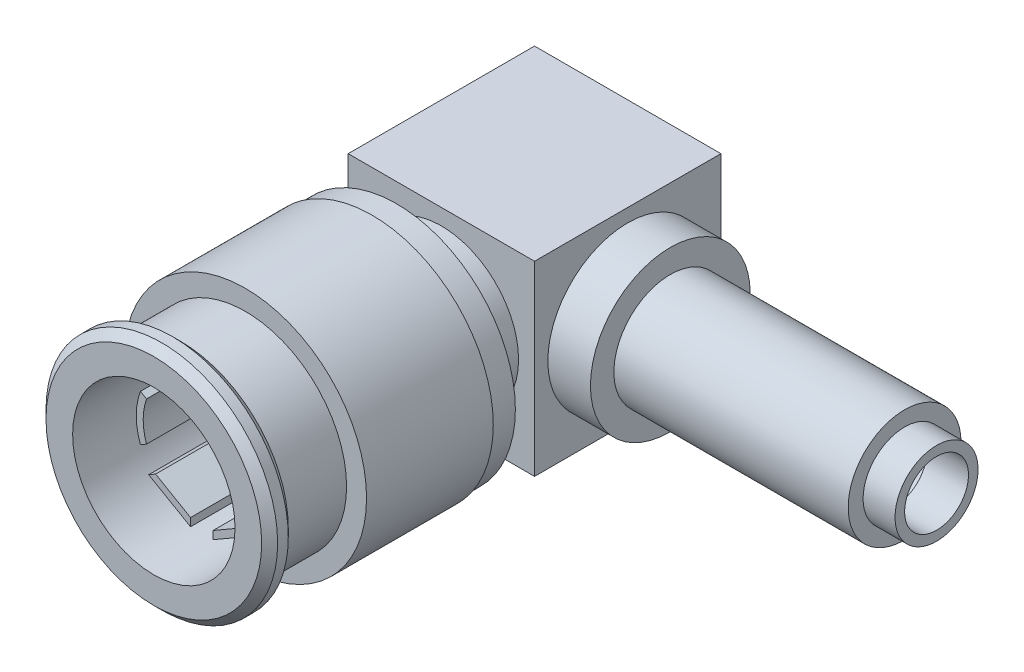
ISO-10303-21;
HEADER;
FILE_DESCRIPTION(('STEP AP214'),'2;1');
FILE_NAME('part.step','',(''),(''),'','','');
FILE_SCHEMA(('AUTOMOTIVE_DESIGN { 1 0 10303 214 1 1 1 1 }'));
ENDSEC;
DATA;
#1=APPLICATION_CONTEXT('core data for automotive mechanical design processes');
#2=APPLICATION_PROTOCOL_DEFINITION('international standard','automotive_design',2000,#1);
#3=PRODUCT_CONTEXT('',#1,'mechanical');
#4=PRODUCT('Part','Part','',(#3));
#5=PRODUCT_RELATED_PRODUCT_CATEGORY('part','',(#4));
#6=PRODUCT_DEFINITION_FORMATION('','',#4);
#7=PRODUCT_DEFINITION_CONTEXT('part definition',#1,'design');
#8=PRODUCT_DEFINITION('design','',#6,#7);
#9=PRODUCT_DEFINITION_SHAPE('','',#8);
#10=(LENGTH_UNIT() NAMED_UNIT(*) SI_UNIT(.MILLI.,.METRE.));
#11=(NAMED_UNIT(*) PLANE_ANGLE_UNIT() SI_UNIT($,.RADIAN.));
#12=(NAMED_UNIT(*) SI_UNIT($,.STERADIAN.) SOLID_ANGLE_UNIT());
#13=UNCERTAINTY_MEASURE_WITH_UNIT(LENGTH_MEASURE(1.E-05),#10,'distance_accuracy_value','');
#14=(GEOMETRIC_REPRESENTATION_CONTEXT(3) GLOBAL_UNCERTAINTY_ASSIGNED_CONTEXT((#13)) GLOBAL_UNIT_ASSIGNED_CONTEXT((#10,
#11,#12)) REPRESENTATION_CONTEXT('',''));
#15=CARTESIAN_POINT('',(0.,0.,0.));
#16=DIRECTION('',(0.,0.,1.));
#17=DIRECTION('',(1.,0.,0.));
#18=AXIS2_PLACEMENT_3D('',#15,#16,#17);
#19=CARTESIAN_POINT('',(0.,0.,-7.11199999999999));
#20=DIRECTION('',(0.,0.,1.));
#21=DIRECTION('',(1.,0.,0.));
#22=AXIS2_PLACEMENT_3D('',#19,#20,#21);
#23=CYLINDRICAL_SURFACE('',#22,3.1242);
#24=CARTESIAN_POINT('',(0.,0.,-6.17219999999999));
#25=DIRECTION('',(0.,0.,1.));
#26=DIRECTION('',(1.,0.,0.));
#27=AXIS2_PLACEMENT_3D('',#24,#25,#26);
#28=CIRCLE('',#27,3.1242);
#29=CARTESIAN_POINT('',(1.59134517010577,2.68853978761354,-6.17219999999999));
#30=VERTEX_POINT('',#29);
#31=CARTESIAN_POINT('',(1.5326711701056,2.72241523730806,-6.17219999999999));
#32=VERTEX_POINT('',#31);
#33=EDGE_CURVE('E1013',#30,#32,#28,.T.);
#34=ORIENTED_EDGE('',*,*,#33,.T.);
#35=DIRECTION('',(0.,0.,1.));
#36=VECTOR('',#35,1.);
#37=CARTESIAN_POINT('',(1.5326711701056,2.72241523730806,-7.11199999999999));
#38=LINE('',#37,#36);
#39=CARTESIAN_POINT('',(1.53267117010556,2.72241523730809,-7.36599999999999));
#40=VERTEX_POINT('',#39);
#41=EDGE_CURVE('E621',#32,#40,#38,.F.);
#42=ORIENTED_EDGE('',*,*,#41,.T.);
#43=CARTESIAN_POINT('',(0.,0.,-7.36599999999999));
#44=DIRECTION('',(0.,0.,1.));
#45=DIRECTION('',(1.,0.,0.));
#46=AXIS2_PLACEMENT_3D('',#43,#44,#45);
#47=CIRCLE('',#46,3.1242);
#48=CARTESIAN_POINT('',(1.59134517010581,2.68853978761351,-7.36599999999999));
#49=VERTEX_POINT('',#48);
#50=EDGE_CURVE('E934',#49,#40,#47,.T.);
#51=ORIENTED_EDGE('',*,*,#50,.F.);
#52=DIRECTION('',(0.,0.,1.));
#53=VECTOR('',#52,1.);
#54=CARTESIAN_POINT('',(1.59134517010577,2.68853978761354,-7.11199999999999));
#55=LINE('',#54,#53);
#56=EDGE_CURVE('E617',#49,#30,#55,.T.);
#57=ORIENTED_EDGE('',*,*,#56,.T.);
#58=EDGE_LOOP('',(#34,#42,#51,#57));
#59=FACE_BOUND('',#58,.T.);
#60=ADVANCED_FACE('F51',(#59),#23,.F.);
#61=DIRECTION('',(0.,0.,1.));
#62=VECTOR('',#61,1.);
#63=CARTESIAN_POINT('',(2.3599545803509,2.04725182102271,-7.11199999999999));
#64=LINE('',#63,#62);
#65=CARTESIAN_POINT('',(2.3599545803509,2.04725182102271,-7.36599999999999));
#66=VERTEX_POINT('',#65);
#67=CARTESIAN_POINT('',(2.3599545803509,2.04725182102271,-6.17219999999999));
#68=VERTEX_POINT('',#67);
#69=EDGE_CURVE('E604',#66,#68,#64,.T.);
#70=ORIENTED_EDGE('',*,*,#69,.F.);
#71=CARTESIAN_POINT('',(2.9236294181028,1.10137035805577,-7.36599999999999));
#72=VERTEX_POINT('',#71);
#73=EDGE_CURVE('E929',#72,#66,#47,.T.);
#74=ORIENTED_EDGE('',*,*,#73,.F.);
#75=DIRECTION('',(0.,0.,1.));
#76=VECTOR('',#75,1.);
#77=CARTESIAN_POINT('',(2.92362941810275,1.1013703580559,-7.11199999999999));
#78=LINE('',#77,#76);
#79=CARTESIAN_POINT('',(2.92362941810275,1.1013703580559,-6.17219999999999));
#80=VERTEX_POINT('',#79);
#81=EDGE_CURVE('E1007',#72,#80,#78,.T.);
#82=ORIENTED_EDGE('',*,*,#81,.T.);
#83=EDGE_CURVE('E1008',#80,#68,#28,.T.);
#84=ORIENTED_EDGE('',*,*,#83,.T.);
#85=EDGE_LOOP('',(#70,#74,#82,#84));
#86=FACE_BOUND('',#85,.T.);
#87=ADVANCED_FACE('F1388',(#86),#23,.F.);
#88=CARTESIAN_POINT('',(0.,0.,-7.36599999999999));
#89=DIRECTION('',(0.,0.,1.));
#90=DIRECTION('',(1.,0.,0.));
#91=AXIS2_PLACEMENT_3D('',#88,#89,#90);
#92=CYLINDRICAL_SURFACE('',#91,2.79400000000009);
#93=CARTESIAN_POINT('',(0.,0.,-7.36599999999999));
#94=DIRECTION('',(0.,0.,-1.));
#95=DIRECTION('',(-1.,0.,0.));
#96=AXIS2_PLACEMENT_3D('',#93,#94,#95);
#97=CIRCLE('',#96,2.79400000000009);
#98=CARTESIAN_POINT('',(1.42623431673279,2.40255940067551,-7.36599999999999));
#99=VERTEX_POINT('',#98);
#100=CARTESIAN_POINT('',(2.6333442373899,0.933774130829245,-7.36599999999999));
#101=VERTEX_POINT('',#100);
#102=EDGE_CURVE('E940',#99,#101,#97,.T.);
#103=ORIENTED_EDGE('',*,*,#102,.F.);
#104=DIRECTION('',(0.,0.,1.));
#105=VECTOR('',#104,1.);
#106=CARTESIAN_POINT('',(1.42623431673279,2.40255940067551,-7.36599999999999));
#107=LINE('',#106,#105);
#108=CARTESIAN_POINT('',(1.42623431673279,2.40255940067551,-7.11199999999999));
#109=VERTEX_POINT('',#108);
#110=EDGE_CURVE('E629',#99,#109,#107,.T.);
#111=ORIENTED_EDGE('',*,*,#110,.T.);
#112=CARTESIAN_POINT('',(0.,0.,-7.11199999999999));
#113=DIRECTION('',(0.,0.,-1.));
#114=DIRECTION('',(-1.,0.,0.));
#115=AXIS2_PLACEMENT_3D('',#112,#113,#114);
#116=CIRCLE('',#115,2.79400000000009);
#117=CARTESIAN_POINT('',(2.6333442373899,0.933774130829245,-7.11199999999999));
#118=VERTEX_POINT('',#117);
#119=EDGE_CURVE('E928',#109,#118,#116,.T.);
#120=ORIENTED_EDGE('',*,*,#119,.T.);
#121=DIRECTION('',(0.,0.,1.));
#122=VECTOR('',#121,1.);
#123=CARTESIAN_POINT('',(2.6333442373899,0.933774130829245,-7.36599999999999));
#124=LINE('',#123,#122);
#125=EDGE_CURVE('E957',#101,#118,#124,.T.);
#126=ORIENTED_EDGE('',*,*,#125,.F.);
#127=EDGE_LOOP('',(#103,#111,#120,#126));
#128=FACE_BOUND('',#127,.T.);
#129=ADVANCED_FACE('F1395',(#128),#92,.T.);
#130=CARTESIAN_POINT('',(0.,0.,-7.36599999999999));
#131=DIRECTION('',(0.,0.,1.));
#132=DIRECTION('',(1.,0.,0.));
#133=AXIS2_PLACEMENT_3D('',#130,#131,#132);
#134=PLANE('',#133);
#135=DIRECTION('',(-0.866025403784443,0.499999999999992,0.));
#136=VECTOR('',#135,1.);
#137=CARTESIAN_POINT('',(1.56200817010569,2.7054775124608,-7.36599999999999));
#138=LINE('',#137,#136);
#139=EDGE_CURVE('E12',#49,#40,#138,.T.);
#140=ORIENTED_EDGE('',*,*,#139,.F.);
#141=ORIENTED_EDGE('',*,*,#50,.T.);
#142=EDGE_LOOP('',(#140,#141));
#143=FACE_BOUND('',#142,.T.);
#144=ADVANCED_FACE('F2672',(#143),#134,.T.);
#145=DIRECTION('',(0.866025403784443,-0.499999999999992,0.));
#146=VECTOR('',#145,1.);
#147=CARTESIAN_POINT('',(1.39689731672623,2.41949712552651,-7.36599999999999));
#148=LINE('',#147,#146);
#149=CARTESIAN_POINT('',(0.534320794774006,2.91750591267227,-7.36599999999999));
#150=VERTEX_POINT('',#149);
#151=CARTESIAN_POINT('',(1.36756031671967,2.43643485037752,-7.36599999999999));
#152=VERTEX_POINT('',#151);
#153=EDGE_CURVE('E62',#150,#152,#148,.T.);
#154=ORIENTED_EDGE('',*,*,#153,.F.);
#155=DIRECTION('',(0.,-1.,0.));
#156=VECTOR('',#155,1.);
#157=CARTESIAN_POINT('',(0.534320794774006,0.,-7.36599999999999));
#158=LINE('',#157,#156);
#159=CARTESIAN_POINT('',(0.534320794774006,3.07816941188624,-7.36599999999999));
#160=VERTEX_POINT('',#159);
#161=EDGE_CURVE('E2734',#160,#150,#158,.T.);
#162=ORIENTED_EDGE('',*,*,#161,.F.);
#163=CARTESIAN_POINT('',(-0.525098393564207,3.07975604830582,-7.36599999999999));
#164=VERTEX_POINT('',#163);
#165=EDGE_CURVE('E935',#160,#164,#47,.T.);
#166=ORIENTED_EDGE('',*,*,#165,.T.);
#167=DIRECTION('',(0.,-1.,0.));
#168=VECTOR('',#167,1.);
#169=CARTESIAN_POINT('',(-0.525098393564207,0.,-7.36599999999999));
#170=LINE('',#169,#168);
#171=CARTESIAN_POINT('',(-0.525098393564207,2.92283046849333,-7.36599999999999));
#172=VERTEX_POINT('',#171);
#173=EDGE_CURVE('E1482',#164,#172,#170,.T.);
#174=ORIENTED_EDGE('',*,*,#173,.T.);
#175=DIRECTION('',(0.866025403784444,0.499999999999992,0.));
#176=VECTOR('',#175,1.);
#177=CARTESIAN_POINT('',(-1.39689731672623,2.41949712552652,-7.36599999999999));
#178=LINE('',#177,#176);
#179=CARTESIAN_POINT('',(-1.36756031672,2.43643485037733,-7.36599999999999));
#180=VERTEX_POINT('',#179);
#181=EDGE_CURVE('E1473',#180,#172,#178,.T.);
#182=ORIENTED_EDGE('',*,*,#181,.F.);
#183=EDGE_CURVE('E946',#180,#152,#97,.T.);
#184=ORIENTED_EDGE('',*,*,#183,.T.);
#185=EDGE_LOOP('',(#154,#162,#166,#174,#182,#184));
#186=FACE_BOUND('',#185,.T.);
#187=ADVANCED_FACE('F2351',(#186),#134,.T.);
#188=CARTESIAN_POINT('',(0.,0.,-7.36599999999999));
#189=DIRECTION('',(0.,0.,1.));
#190=DIRECTION('',(1.,0.,0.));
#191=AXIS2_PLACEMENT_3D('',#188,#189,#190);
#192=CYLINDRICAL_SURFACE('',#191,2.79400000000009);
#193=CARTESIAN_POINT('',(0.,0.,-7.36599999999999));
#194=DIRECTION('',(0.,0.,-1.));
#195=DIRECTION('',(-1.,0.,0.));
#196=AXIS2_PLACEMENT_3D('',#193,#194,#195);
#197=CIRCLE('',#196,2.79400000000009);
#198=CARTESIAN_POINT('',(-1.42623431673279,-2.40255940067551,-7.36599999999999));
#199=VERTEX_POINT('',#198);
#200=CARTESIAN_POINT('',(-2.63334423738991,-0.933774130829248,-7.36599999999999));
#201=VERTEX_POINT('',#200);
#202=EDGE_CURVE('E974',#199,#201,#197,.T.);
#203=ORIENTED_EDGE('',*,*,#202,.F.);
#204=DIRECTION('',(0.,0.,1.));
#205=VECTOR('',#204,1.);
#206=CARTESIAN_POINT('',(-1.42623431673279,-2.40255940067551,-7.36599999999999));
#207=LINE('',#206,#205);
#208=CARTESIAN_POINT('',(-1.42623431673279,-2.40255940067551,-7.11199999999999));
#209=VERTEX_POINT('',#208);
#210=EDGE_CURVE('E708',#199,#209,#207,.T.);
#211=ORIENTED_EDGE('',*,*,#210,.T.);
#212=CARTESIAN_POINT('',(0.,0.,-7.11199999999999));
#213=DIRECTION('',(0.,0.,-1.));
#214=DIRECTION('',(-1.,0.,0.));
#215=AXIS2_PLACEMENT_3D('',#212,#213,#214);
#216=CIRCLE('',#215,2.79400000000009);
#217=CARTESIAN_POINT('',(-2.63334423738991,-0.933774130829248,-7.11199999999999));
#218=VERTEX_POINT('',#217);
#219=EDGE_CURVE('E961',#209,#218,#216,.T.);
#220=ORIENTED_EDGE('',*,*,#219,.T.);
#221=DIRECTION('',(0.,0.,1.));
#222=VECTOR('',#221,1.);
#223=CARTESIAN_POINT('',(-2.63334423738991,-0.933774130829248,-7.36599999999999));
#224=LINE('',#223,#222);
#225=EDGE_CURVE('E991',#201,#218,#224,.T.);
#226=ORIENTED_EDGE('',*,*,#225,.F.);
#227=EDGE_LOOP('',(#203,#211,#220,#226));
#228=FACE_BOUND('',#227,.T.);
#229=ADVANCED_FACE('F1413',(#228),#192,.T.);
#230=CARTESIAN_POINT('',(0.,0.,-7.36599999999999));
#231=DIRECTION('',(0.,0.,1.));
#232=DIRECTION('',(1.,0.,0.));
#233=AXIS2_PLACEMENT_3D('',#230,#231,#232);
#234=PLANE('',#233);
#235=DIRECTION('',(0.866025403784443,-0.499999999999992,0.));
#236=VECTOR('',#235,1.);
#237=CARTESIAN_POINT('',(-1.56200817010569,-2.7054775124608,-7.36599999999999));
#238=LINE('',#237,#236);
#239=CARTESIAN_POINT('',(-1.59134517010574,-2.68853978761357,-7.36599999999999));
#240=VERTEX_POINT('',#239);
#241=CARTESIAN_POINT('',(-1.53267117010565,-2.72241523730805,-7.36599999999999));
#242=VERTEX_POINT('',#241);
#243=EDGE_CURVE('E696',#240,#242,#238,.T.);
#244=ORIENTED_EDGE('',*,*,#243,.F.);
#245=CARTESIAN_POINT('',(0.,0.,-7.36599999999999));
#246=DIRECTION('',(0.,0.,1.));
#247=DIRECTION('',(1.,0.,0.));
#248=AXIS2_PLACEMENT_3D('',#245,#246,#247);
#249=CIRCLE('',#248,3.12420000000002);
#250=EDGE_CURVE('E968',#240,#242,#249,.T.);
#251=ORIENTED_EDGE('',*,*,#250,.T.);
#252=EDGE_LOOP('',(#244,#251));
#253=FACE_BOUND('',#252,.T.);
#254=ADVANCED_FACE('F2475',(#253),#234,.T.);
#255=DIRECTION('',(-0.866025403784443,0.499999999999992,0.));
#256=VECTOR('',#255,1.);
#257=CARTESIAN_POINT('',(-1.39689731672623,-2.41949712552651,-7.36599999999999));
#258=LINE('',#257,#256);
#259=CARTESIAN_POINT('',(-2.20079983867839,-1.95536378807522,-7.36599999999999));
#260=VERTEX_POINT('',#259);
#261=EDGE_CURVE('E711',#199,#260,#258,.T.);
#262=ORIENTED_EDGE('',*,*,#261,.F.);
#263=ORIENTED_EDGE('',*,*,#202,.T.);
#264=DIRECTION('',(-0.866025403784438,-0.5,0.));
#265=VECTOR('',#264,1.);
#266=CARTESIAN_POINT('',(-2.63334423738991,-0.933774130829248,-7.36599999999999));
#267=LINE('',#266,#265);
#268=CARTESIAN_POINT('',(-2.92362941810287,-1.10137035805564,-7.36599999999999));
#269=VERTEX_POINT('',#268);
#270=EDGE_CURVE('E979',#201,#269,#267,.T.);
#271=ORIENTED_EDGE('',*,*,#270,.T.);
#272=CARTESIAN_POINT('',(-2.35995458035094,-2.04725182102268,-7.36599999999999));
#273=VERTEX_POINT('',#272);
#274=EDGE_CURVE('E964',#269,#273,#249,.T.);
#275=ORIENTED_EDGE('',*,*,#274,.T.);
#276=DIRECTION('',(-0.866025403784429,-0.500000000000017,0.));
#277=VECTOR('',#276,1.);
#278=CARTESIAN_POINT('',(0.296497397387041,-0.513548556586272,-7.36599999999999));
#279=LINE('',#278,#277);
#280=EDGE_CURVE('E83',#260,#273,#279,.T.);
#281=ORIENTED_EDGE('',*,*,#280,.F.);
#282=EDGE_LOOP('',(#262,#263,#271,#275,#281));
#283=FACE_BOUND('',#282,.T.);
#284=ADVANCED_FACE('F2461',(#283),#234,.T.);
#285=CARTESIAN_POINT('',(0.,0.,-7.11199999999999));
#286=DIRECTION('',(0.,0.,1.));
#287=DIRECTION('',(1.,0.,0.));
#288=AXIS2_PLACEMENT_3D('',#285,#286,#287);
#289=CYLINDRICAL_SURFACE('',#288,3.1242);
#290=CARTESIAN_POINT('',(0.,0.,-6.17219999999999));
#291=DIRECTION('',(0.,0.,1.));
#292=DIRECTION('',(1.,0.,0.));
#293=AXIS2_PLACEMENT_3D('',#290,#291,#292);
#294=CIRCLE('',#293,3.1242);
#295=CARTESIAN_POINT('',(-1.59134517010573,-2.68853978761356,-6.17219999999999));
#296=VERTEX_POINT('',#295);
#297=CARTESIAN_POINT('',(-1.53267117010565,-2.72241523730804,-6.17219999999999));
#298=VERTEX_POINT('',#297);
#299=EDGE_CURVE('E1019',#296,#298,#294,.T.);
#300=ORIENTED_EDGE('',*,*,#299,.T.);
#301=DIRECTION('',(0.,0.,1.));
#302=VECTOR('',#301,1.);
#303=CARTESIAN_POINT('',(-1.53267117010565,-2.72241523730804,-7.11199999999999));
#304=LINE('',#303,#302);
#305=EDGE_CURVE('E2749',#298,#242,#304,.F.);
#306=ORIENTED_EDGE('',*,*,#305,.T.);
#307=ORIENTED_EDGE('',*,*,#250,.F.);
#308=DIRECTION('',(0.,0.,1.));
#309=VECTOR('',#308,1.);
#310=CARTESIAN_POINT('',(-1.59134517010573,-2.68853978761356,-7.11199999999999));
#311=LINE('',#310,#309);
#312=EDGE_CURVE('E2752',#240,#296,#311,.T.);
#313=ORIENTED_EDGE('',*,*,#312,.T.);
#314=EDGE_LOOP('',(#300,#306,#307,#313));
#315=FACE_BOUND('',#314,.T.);
#316=ADVANCED_FACE('F1417',(#315),#289,.F.);
#317=DIRECTION('',(0.,0.,1.));
#318=VECTOR('',#317,1.);
#319=CARTESIAN_POINT('',(-0.534320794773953,-3.07816941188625,-7.11199999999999));
#320=LINE('',#319,#318);
#321=CARTESIAN_POINT('',(-0.534320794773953,-3.07816941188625,-6.17219999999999));
#322=VERTEX_POINT('',#321);
#323=CARTESIAN_POINT('',(-0.534320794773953,-3.07816941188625,-7.36599999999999));
#324=VERTEX_POINT('',#323);
#325=EDGE_CURVE('E2758',#322,#324,#320,.F.);
#326=ORIENTED_EDGE('',*,*,#325,.F.);
#327=CARTESIAN_POINT('',(0.541451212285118,-3.07692317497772,-6.17219999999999));
#328=VERTEX_POINT('',#327);
#329=EDGE_CURVE('E1020',#322,#328,#294,.T.);
#330=ORIENTED_EDGE('',*,*,#329,.T.);
#331=DIRECTION('',(0.,0.,1.));
#332=VECTOR('',#331,1.);
#333=CARTESIAN_POINT('',(0.541451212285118,-3.07692317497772,-7.11199999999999));
#334=LINE('',#333,#332);
#335=CARTESIAN_POINT('',(0.541451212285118,-3.07692317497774,-7.36599999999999));
#336=VERTEX_POINT('',#335);
#337=EDGE_CURVE('E761',#328,#336,#334,.F.);
#338=ORIENTED_EDGE('',*,*,#337,.T.);
#339=EDGE_CURVE('E969',#324,#336,#249,.T.);
#340=ORIENTED_EDGE('',*,*,#339,.F.);
#341=EDGE_LOOP('',(#326,#330,#338,#340));
#342=FACE_BOUND('',#341,.T.);
#343=ADVANCED_FACE('F2436',(#342),#289,.F.);
#344=CARTESIAN_POINT('',(1.53267117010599,-2.72241523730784,-6.17219999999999));
#345=VERTEX_POINT('',#344);
#346=CARTESIAN_POINT('',(1.59134517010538,-2.68853978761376,-6.17219999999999));
#347=VERTEX_POINT('',#346);
#348=EDGE_CURVE('E1021',#345,#347,#294,.T.);
#349=ORIENTED_EDGE('',*,*,#348,.T.);
#350=DIRECTION('',(0.,0.,1.));
#351=VECTOR('',#350,1.);
#352=CARTESIAN_POINT('',(1.59134517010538,-2.68853978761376,-7.11199999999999));
#353=LINE('',#352,#351);
#354=CARTESIAN_POINT('',(1.59134517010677,-2.68853978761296,-7.36599999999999));
#355=VERTEX_POINT('',#354);
#356=EDGE_CURVE('E773',#347,#355,#353,.F.);
#357=ORIENTED_EDGE('',*,*,#356,.T.);
#358=CARTESIAN_POINT('',(1.53267117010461,-2.72241523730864,-7.36599999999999));
#359=VERTEX_POINT('',#358);
#360=EDGE_CURVE('E970',#359,#355,#249,.T.);
#361=ORIENTED_EDGE('',*,*,#360,.F.);
#362=DIRECTION('',(0.,0.,1.));
#363=VECTOR('',#362,1.);
#364=CARTESIAN_POINT('',(1.53267117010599,-2.72241523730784,-7.11199999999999));
#365=LINE('',#364,#363);
#366=EDGE_CURVE('E769',#359,#345,#365,.T.);
#367=ORIENTED_EDGE('',*,*,#366,.T.);
#368=EDGE_LOOP('',(#349,#357,#361,#367));
#369=FACE_BOUND('',#368,.T.);
#370=ADVANCED_FACE('F2431',(#369),#289,.F.);
#371=DIRECTION('',(0.,0.,1.));
#372=VECTOR('',#371,1.);
#373=CARTESIAN_POINT('',(2.35518814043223,-2.05273341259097,-7.11199999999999));
#374=LINE('',#373,#372);
#375=CARTESIAN_POINT('',(2.35518814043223,-2.05273341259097,-6.17219999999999));
#376=VERTEX_POINT('',#375);
#377=CARTESIAN_POINT('',(2.35518814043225,-2.05273341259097,-7.36599999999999));
#378=VERTEX_POINT('',#377);
#379=EDGE_CURVE('E726',#376,#378,#374,.F.);
#380=ORIENTED_EDGE('',*,*,#379,.F.);
#381=CARTESIAN_POINT('',(2.92362941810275,-1.10137035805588,-6.17219999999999));
#382=VERTEX_POINT('',#381);
#383=EDGE_CURVE('E1012',#376,#382,#294,.T.);
#384=ORIENTED_EDGE('',*,*,#383,.T.);
#385=DIRECTION('',(0.,0.,1.));
#386=VECTOR('',#385,1.);
#387=CARTESIAN_POINT('',(2.92362941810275,-1.10137035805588,-7.11199999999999));
#388=LINE('',#387,#386);
#389=CARTESIAN_POINT('',(2.92362941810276,-1.10137035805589,-7.36599999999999));
#390=VERTEX_POINT('',#389);
#391=EDGE_CURVE('E1022',#390,#382,#388,.T.);
#392=ORIENTED_EDGE('',*,*,#391,.F.);
#393=EDGE_CURVE('E989',#378,#390,#249,.T.);
#394=ORIENTED_EDGE('',*,*,#393,.F.);
#395=EDGE_LOOP('',(#380,#384,#392,#394));
#396=FACE_BOUND('',#395,.T.);
#397=ADVANCED_FACE('F1418',(#396),#289,.F.);
#398=CARTESIAN_POINT('',(1.36756031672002,-2.43643485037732,-7.11199999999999));
#399=VERTEX_POINT('',#398);
#400=CARTESIAN_POINT('',(-1.36756031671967,-2.43643485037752,-7.11199999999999));
#401=VERTEX_POINT('',#400);
#402=EDGE_CURVE('E990',#399,#401,#216,.T.);
#403=ORIENTED_EDGE('',*,*,#402,.T.);
#404=DIRECTION('',(0.,0.,1.));
#405=VECTOR('',#404,1.);
#406=CARTESIAN_POINT('',(-1.36756031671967,-2.43643485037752,-7.36599999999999));
#407=LINE('',#406,#405);
#408=CARTESIAN_POINT('',(-1.36756031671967,-2.43643485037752,-7.36599999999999));
#409=VERTEX_POINT('',#408);
#410=EDGE_CURVE('E705',#401,#409,#407,.F.);
#411=ORIENTED_EDGE('',*,*,#410,.T.);
#412=CARTESIAN_POINT('',(1.36756031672,-2.43643485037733,-7.36599999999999));
#413=VERTEX_POINT('',#412);
#414=EDGE_CURVE('E980',#413,#409,#197,.T.);
#415=ORIENTED_EDGE('',*,*,#414,.F.);
#416=DIRECTION('',(0.,0.,1.));
#417=VECTOR('',#416,1.);
#418=CARTESIAN_POINT('',(1.36756031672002,-2.43643485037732,-7.36599999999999));
#419=LINE('',#418,#417);
#420=EDGE_CURVE('E782',#413,#399,#419,.T.);
#421=ORIENTED_EDGE('',*,*,#420,.T.);
#422=EDGE_LOOP('',(#403,#411,#415,#421));
#423=FACE_BOUND('',#422,.T.);
#424=ADVANCED_FACE('F1414',(#423),#192,.T.);
#425=DIRECTION('',(0.866025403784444,0.499999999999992,0.));
#426=VECTOR('',#425,1.);
#427=CARTESIAN_POINT('',(1.56200817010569,-2.7054775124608,-7.36599999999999));
#428=LINE('',#427,#426);
#429=EDGE_CURVE('E2762',#359,#355,#428,.T.);
#430=ORIENTED_EDGE('',*,*,#429,.F.);
#431=ORIENTED_EDGE('',*,*,#360,.T.);
#432=EDGE_LOOP('',(#430,#431));
#433=FACE_BOUND('',#432,.T.);
#434=ADVANCED_FACE('F2454',(#433),#234,.T.);
#435=CARTESIAN_POINT('',(-0.534320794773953,-2.9175059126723,-7.36599999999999));
#436=VERTEX_POINT('',#435);
#437=EDGE_CURVE('E714',#436,#409,#258,.T.);
#438=ORIENTED_EDGE('',*,*,#437,.F.);
#439=DIRECTION('',(0.,-1.,0.));
#440=VECTOR('',#439,1.);
#441=CARTESIAN_POINT('',(-0.534320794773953,0.,-7.36599999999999));
#442=LINE('',#441,#440);
#443=EDGE_CURVE('E684',#436,#324,#442,.T.);
#444=ORIENTED_EDGE('',*,*,#443,.T.);
#445=ORIENTED_EDGE('',*,*,#339,.T.);
#446=DIRECTION('',(0.,-1.,0.));
#447=VECTOR('',#446,1.);
#448=CARTESIAN_POINT('',(0.541451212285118,0.,-7.36599999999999));
#449=LINE('',#448,#447);
#450=CARTESIAN_POINT('',(0.541451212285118,-2.9133891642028,-7.36599999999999));
#451=VERTEX_POINT('',#450);
#452=EDGE_CURVE('E2766',#451,#336,#449,.T.);
#453=ORIENTED_EDGE('',*,*,#452,.F.);
#454=DIRECTION('',(-0.866025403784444,-0.499999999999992,0.));
#455=VECTOR('',#454,1.);
#456=CARTESIAN_POINT('',(1.39689731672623,-2.41949712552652,-7.36599999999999));
#457=LINE('',#456,#455);
#458=EDGE_CURVE('E2765',#413,#451,#457,.T.);
#459=ORIENTED_EDGE('',*,*,#458,.F.);
#460=ORIENTED_EDGE('',*,*,#414,.T.);
#461=EDGE_LOOP('',(#438,#444,#445,#453,#459,#460));
#462=FACE_BOUND('',#461,.T.);
#463=ADVANCED_FACE('F1431',(#462),#234,.T.);
#464=CARTESIAN_POINT('',(-1.53267117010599,2.72241523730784,-6.17219999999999));
#465=VERTEX_POINT('',#464);
#466=CARTESIAN_POINT('',(-1.59134517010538,2.68853978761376,-6.17219999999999));
#467=VERTEX_POINT('',#466);
#468=EDGE_CURVE('E1015',#465,#467,#28,.T.);
#469=ORIENTED_EDGE('',*,*,#468,.T.);
#470=DIRECTION('',(0.,0.,1.));
#471=VECTOR('',#470,1.);
#472=CARTESIAN_POINT('',(-1.59134517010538,2.68853978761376,-7.11199999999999));
#473=LINE('',#472,#471);
#474=CARTESIAN_POINT('',(-1.59134517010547,2.68853978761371,-7.36599999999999));
#475=VERTEX_POINT('',#474);
#476=EDGE_CURVE('E863',#467,#475,#473,.F.);
#477=ORIENTED_EDGE('',*,*,#476,.T.);
#478=CARTESIAN_POINT('',(-1.53267117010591,2.72241523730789,-7.36599999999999));
#479=VERTEX_POINT('',#478);
#480=EDGE_CURVE('E936',#479,#475,#47,.T.);
#481=ORIENTED_EDGE('',*,*,#480,.F.);
#482=DIRECTION('',(0.,0.,1.));
#483=VECTOR('',#482,1.);
#484=CARTESIAN_POINT('',(-1.53267117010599,2.72241523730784,-7.11199999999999));
#485=LINE('',#484,#483);
#486=EDGE_CURVE('E859',#479,#465,#485,.T.);
#487=ORIENTED_EDGE('',*,*,#486,.T.);
#488=EDGE_LOOP('',(#469,#477,#481,#487));
#489=FACE_BOUND('',#488,.T.);
#490=ADVANCED_FACE('F1397',(#489),#23,.F.);
#491=ORIENTED_EDGE('',*,*,#165,.F.);
#492=DIRECTION('',(0.,0.,1.));
#493=VECTOR('',#492,1.);
#494=CARTESIAN_POINT('',(0.534320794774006,3.07816941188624,-7.11199999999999));
#495=LINE('',#494,#493);
#496=CARTESIAN_POINT('',(0.534320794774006,3.07816941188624,-6.17219999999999));
#497=VERTEX_POINT('',#496);
#498=EDGE_CURVE('E611',#160,#497,#495,.T.);
#499=ORIENTED_EDGE('',*,*,#498,.T.);
#500=CARTESIAN_POINT('',(-0.525098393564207,3.07975604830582,-6.17219999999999));
#501=VERTEX_POINT('',#500);
#502=EDGE_CURVE('E1014',#497,#501,#28,.T.);
#503=ORIENTED_EDGE('',*,*,#502,.T.);
#504=DIRECTION('',(0.,0.,1.));
#505=VECTOR('',#504,1.);
#506=CARTESIAN_POINT('',(-0.525098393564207,3.07975604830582,-7.11199999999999));
#507=LINE('',#506,#505);
#508=EDGE_CURVE('E805',#164,#501,#507,.T.);
#509=ORIENTED_EDGE('',*,*,#508,.F.);
#510=EDGE_LOOP('',(#491,#499,#503,#509));
#511=FACE_BOUND('',#510,.T.);
#512=ADVANCED_FACE('F1405',(#511),#23,.F.);
#513=CARTESIAN_POINT('',(-1.36756031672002,2.43643485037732,-7.11199999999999));
#514=VERTEX_POINT('',#513);
#515=CARTESIAN_POINT('',(1.36756031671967,2.43643485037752,-7.11199999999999));
#516=VERTEX_POINT('',#515);
#517=EDGE_CURVE('E956',#514,#516,#116,.T.);
#518=ORIENTED_EDGE('',*,*,#517,.T.);
#519=DIRECTION('',(0.,0.,1.));
#520=VECTOR('',#519,1.);
#521=CARTESIAN_POINT('',(1.36756031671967,2.43643485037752,-7.36599999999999));
#522=LINE('',#521,#520);
#523=EDGE_CURVE('E636',#516,#152,#522,.F.);
#524=ORIENTED_EDGE('',*,*,#523,.T.);
#525=ORIENTED_EDGE('',*,*,#183,.F.);
#526=DIRECTION('',(0.,0.,1.));
#527=VECTOR('',#526,1.);
#528=CARTESIAN_POINT('',(-1.36756031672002,2.43643485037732,-7.36599999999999));
#529=LINE('',#528,#527);
#530=EDGE_CURVE('E848',#180,#514,#529,.T.);
#531=ORIENTED_EDGE('',*,*,#530,.T.);
#532=EDGE_LOOP('',(#518,#524,#525,#531));
#533=FACE_BOUND('',#532,.T.);
#534=ADVANCED_FACE('F1421',(#533),#92,.T.);
#535=DIRECTION('',(-0.866025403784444,-0.499999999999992,0.));
#536=VECTOR('',#535,1.);
#537=CARTESIAN_POINT('',(-1.56200817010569,2.7054775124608,-7.36599999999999));
#538=LINE('',#537,#536);
#539=EDGE_CURVE('E1471',#479,#475,#538,.T.);
#540=ORIENTED_EDGE('',*,*,#539,.F.);
#541=ORIENTED_EDGE('',*,*,#480,.T.);
#542=EDGE_LOOP('',(#540,#541));
#543=FACE_BOUND('',#542,.T.);
#544=ADVANCED_FACE('F1427',(#543),#134,.T.);
#545=CARTESIAN_POINT('',(-2.21002223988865,1.95003923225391,-7.36599999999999));
#546=VERTEX_POINT('',#545);
#547=CARTESIAN_POINT('',(-1.42623431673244,2.40255940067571,-7.36599999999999));
#548=VERTEX_POINT('',#547);
#549=EDGE_CURVE('E1467',#546,#548,#178,.T.);
#550=ORIENTED_EDGE('',*,*,#549,.F.);
#551=DIRECTION('',(0.866025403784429,-0.500000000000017,0.));
#552=VECTOR('',#551,1.);
#553=CARTESIAN_POINT('',(0.291886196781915,0.505561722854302,-7.36599999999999));
#554=LINE('',#553,#552);
#555=CARTESIAN_POINT('',(-2.3660973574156,2.0401492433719,-7.36599999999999));
#556=VERTEX_POINT('',#555);
#557=EDGE_CURVE('E1456',#556,#546,#554,.T.);
#558=ORIENTED_EDGE('',*,*,#557,.F.);
#559=CARTESIAN_POINT('',(-2.92362941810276,1.10137035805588,-7.36599999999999));
#560=VERTEX_POINT('',#559);
#561=EDGE_CURVE('E955',#556,#560,#47,.T.);
#562=ORIENTED_EDGE('',*,*,#561,.T.);
#563=DIRECTION('',(0.866025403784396,-0.500000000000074,0.));
#564=VECTOR('',#563,1.);
#565=CARTESIAN_POINT('',(-2.92362941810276,1.10137035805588,-7.36599999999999));
#566=LINE('',#565,#564);
#567=CARTESIAN_POINT('',(-2.63334423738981,0.933774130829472,-7.36599999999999));
#568=VERTEX_POINT('',#567);
#569=EDGE_CURVE('E933',#560,#568,#566,.T.);
#570=ORIENTED_EDGE('',*,*,#569,.T.);
#571=EDGE_CURVE('E941',#568,#548,#97,.T.);
#572=ORIENTED_EDGE('',*,*,#571,.T.);
#573=EDGE_LOOP('',(#550,#558,#562,#570,#572));
#574=FACE_BOUND('',#573,.T.);
#575=ADVANCED_FACE('F1454',(#574),#134,.T.);
#576=CARTESIAN_POINT('',(17.1958,0.,-18.161));
#577=DIRECTION('',(-1.,0.,0.));
#578=DIRECTION('',(0.,0.,1.));
#579=AXIS2_PLACEMENT_3D('',#576,#577,#578);
#580=CYLINDRICAL_SURFACE('',#579,2.2352);
#581=CARTESIAN_POINT('',(17.1958,0.,-18.161));
#582=DIRECTION('',(-1.,0.,0.));
#583=DIRECTION('',(0.,0.,-1.));
#584=AXIS2_PLACEMENT_3D('',#581,#582,#583);
#585=CIRCLE('',#584,2.2352);
#586=CARTESIAN_POINT('',(17.1958,0.,-20.3962));
#587=VERTEX_POINT('',#586);
#588=EDGE_CURVE('E901',#587,#587,#585,.T.);
#589=ORIENTED_EDGE('',*,*,#588,.F.);
#590=EDGE_LOOP('',(#589));
#591=FACE_BOUND('',#590,.T.);
#592=CARTESIAN_POINT('',(6.477,0.,-18.161));
#593=DIRECTION('',(-1.,0.,0.));
#594=DIRECTION('',(0.,0.,-1.));
#595=AXIS2_PLACEMENT_3D('',#592,#593,#594);
#596=CIRCLE('',#595,2.2352);
#597=CARTESIAN_POINT('',(6.477,0.,-20.3962));
#598=VERTEX_POINT('',#597);
#599=EDGE_CURVE('E900',#598,#598,#596,.T.);
#600=ORIENTED_EDGE('',*,*,#599,.T.);
#601=EDGE_LOOP('',(#600));
#602=FACE_BOUND('',#601,.T.);
#603=ADVANCED_FACE('F2215',(#591,#602),#580,.F.);
#604=CARTESIAN_POINT('',(17.1958,0.,-18.161));
#605=DIRECTION('',(1.,0.,0.));
#606=DIRECTION('',(0.,0.,-1.));
#607=AXIS2_PLACEMENT_3D('',#604,#605,#606);
#608=PLANE('',#607);
#609=CARTESIAN_POINT('',(17.1958,0.,-18.161));
#610=DIRECTION('',(-1.,0.,0.));
#611=DIRECTION('',(0.,0.,1.));
#612=AXIS2_PLACEMENT_3D('',#609,#610,#611);
#613=CIRCLE('',#612,1.524);
#614=CARTESIAN_POINT('',(17.1958,0.,-16.637));
#615=VERTEX_POINT('',#614);
#616=EDGE_CURVE('E892',#615,#615,#613,.T.);
#617=ORIENTED_EDGE('',*,*,#616,.F.);
#618=EDGE_LOOP('',(#617));
#619=FACE_BOUND('',#618,.T.);
#620=ORIENTED_EDGE('',*,*,#588,.T.);
#621=EDGE_LOOP('',(#620));
#622=FACE_BOUND('',#621,.T.);
#623=ADVANCED_FACE('F2220',(#619,#622),#608,.F.);
#624=CARTESIAN_POINT('',(6.477,0.,-18.161));
#625=DIRECTION('',(1.,0.,0.));
#626=DIRECTION('',(0.,0.,-1.));
#627=AXIS2_PLACEMENT_3D('',#624,#625,#626);
#628=PLANE('',#627);
#629=CARTESIAN_POINT('',(6.477,0.,-18.161));
#630=DIRECTION('',(1.,0.,0.));
#631=DIRECTION('',(0.,0.,-1.));
#632=AXIS2_PLACEMENT_3D('',#629,#630,#631);
#633=CIRCLE('',#632,1.9431);
#634=CARTESIAN_POINT('',(6.477,0.,-20.1041));
#635=VERTEX_POINT('',#634);
#636=EDGE_CURVE('E1485',#635,#635,#633,.T.);
#637=ORIENTED_EDGE('',*,*,#636,.F.);
#638=EDGE_LOOP('',(#637));
#639=FACE_BOUND('',#638,.T.);
#640=ORIENTED_EDGE('',*,*,#599,.F.);
#641=EDGE_LOOP('',(#640));
#642=FACE_BOUND('',#641,.T.);
#643=ADVANCED_FACE('F2231',(#639,#642),#628,.T.);
#644=CARTESIAN_POINT('',(19.177,0.,-18.161));
#645=DIRECTION('',(-1.,0.,0.));
#646=DIRECTION('',(0.,0.,1.));
#647=AXIS2_PLACEMENT_3D('',#644,#645,#646);
#648=CYLINDRICAL_SURFACE('',#647,1.524);
#649=CARTESIAN_POINT('',(19.177,0.,-18.161));
#650=DIRECTION('',(-1.,0.,0.));
#651=DIRECTION('',(0.,0.,1.));
#652=AXIS2_PLACEMENT_3D('',#649,#650,#651);
#653=CIRCLE('',#652,1.524);
#654=CARTESIAN_POINT('',(19.177,0.,-16.637));
#655=VERTEX_POINT('',#654);
#656=EDGE_CURVE('E896',#655,#655,#653,.T.);
#657=ORIENTED_EDGE('',*,*,#656,.F.);
#658=EDGE_LOOP('',(#657));
#659=FACE_BOUND('',#658,.T.);
#660=ORIENTED_EDGE('',*,*,#616,.T.);
#661=EDGE_LOOP('',(#660));
#662=FACE_BOUND('',#661,.T.);
#663=ADVANCED_FACE('F2239',(#659,#662),#648,.F.);
#664=CARTESIAN_POINT('',(0.,0.,-7.11199999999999));
#665=DIRECTION('',(0.,0.,1.));
#666=DIRECTION('',(1.,0.,0.));
#667=AXIS2_PLACEMENT_3D('',#664,#665,#666);
#668=PLANE('',#667);
#669=DIRECTION('',(0.866025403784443,-0.499999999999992,0.));
#670=VECTOR('',#669,1.);
#671=CARTESIAN_POINT('',(1.39689731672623,2.41949712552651,-7.11199999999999));
#672=LINE('',#671,#670);
#673=EDGE_CURVE('E633',#516,#109,#672,.T.);
#674=ORIENTED_EDGE('',*,*,#673,.F.);
#675=ORIENTED_EDGE('',*,*,#517,.F.);
#676=DIRECTION('',(0.866025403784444,0.499999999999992,0.));
#677=VECTOR('',#676,1.);
#678=CARTESIAN_POINT('',(-1.39689731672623,2.41949712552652,-7.11199999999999));
#679=LINE('',#678,#677);
#680=CARTESIAN_POINT('',(-1.42623431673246,2.4025594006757,-7.11199999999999));
#681=VERTEX_POINT('',#680);
#682=EDGE_CURVE('E852',#681,#514,#679,.T.);
#683=ORIENTED_EDGE('',*,*,#682,.F.);
#684=CARTESIAN_POINT('',(-2.63334423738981,0.933774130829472,-7.11199999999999));
#685=VERTEX_POINT('',#684);
#686=EDGE_CURVE('E951',#685,#681,#116,.T.);
#687=ORIENTED_EDGE('',*,*,#686,.F.);
#688=CARTESIAN_POINT('',(0.,0.,-7.11199999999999));
#689=DIRECTION('',(0.,0.,1.));
#690=DIRECTION('',(1.,0.,0.));
#691=AXIS2_PLACEMENT_3D('',#688,#689,#690);
#692=CIRCLE('',#691,2.79400000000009);
#693=EDGE_CURVE('E1002',#685,#218,#692,.T.);
#694=ORIENTED_EDGE('',*,*,#693,.T.);
#695=ORIENTED_EDGE('',*,*,#219,.F.);
#696=DIRECTION('',(-0.866025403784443,0.499999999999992,0.));
#697=VECTOR('',#696,1.);
#698=CARTESIAN_POINT('',(-1.39689731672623,-2.41949712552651,-7.11199999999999));
#699=LINE('',#698,#697);
#700=EDGE_CURVE('E701',#401,#209,#699,.T.);
#701=ORIENTED_EDGE('',*,*,#700,.F.);
#702=ORIENTED_EDGE('',*,*,#402,.F.);
#703=DIRECTION('',(-0.866025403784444,-0.499999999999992,0.));
#704=VECTOR('',#703,1.);
#705=CARTESIAN_POINT('',(1.39689731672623,-2.41949712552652,-7.11199999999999));
#706=LINE('',#705,#704);
#707=CARTESIAN_POINT('',(1.42623431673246,-2.4025594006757,-7.11199999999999));
#708=VERTEX_POINT('',#707);
#709=EDGE_CURVE('E786',#708,#399,#706,.T.);
#710=ORIENTED_EDGE('',*,*,#709,.F.);
#711=CARTESIAN_POINT('',(2.63334423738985,-0.933774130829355,-7.11199999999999));
#712=VERTEX_POINT('',#711);
#713=EDGE_CURVE('E985',#712,#708,#216,.T.);
#714=ORIENTED_EDGE('',*,*,#713,.F.);
#715=CARTESIAN_POINT('',(0.,0.,-7.11199999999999));
#716=DIRECTION('',(0.,0.,1.));
#717=DIRECTION('',(1.,0.,0.));
#718=AXIS2_PLACEMENT_3D('',#715,#716,#717);
#719=CIRCLE('',#718,2.79400000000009);
#720=EDGE_CURVE('E998',#712,#118,#719,.T.);
#721=ORIENTED_EDGE('',*,*,#720,.T.);
#722=ORIENTED_EDGE('',*,*,#119,.F.);
#723=EDGE_LOOP('',(#674,#675,#683,#687,#694,#695,#701,#702,#710,#714,#721,#722));
#724=FACE_BOUND('',#723,.T.);
#725=CARTESIAN_POINT('',(0.,0.,-7.11199999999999));
#726=DIRECTION('',(0.,0.,1.));
#727=DIRECTION('',(1.,0.,0.));
#728=AXIS2_PLACEMENT_3D('',#725,#726,#727);
#729=CIRCLE('',#728,0.328930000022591);
#730=CARTESIAN_POINT('',(0.328930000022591,0.,-7.11199999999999));
#731=VERTEX_POINT('',#730);
#732=EDGE_CURVE('E1488',#731,#731,#729,.T.);
#733=ORIENTED_EDGE('',*,*,#732,.F.);
#734=EDGE_LOOP('',(#733));
#735=FACE_BOUND('',#734,.T.);
#736=ADVANCED_FACE('F2244',(#724,#735),#668,.T.);
#737=CARTESIAN_POINT('',(0.,0.,-6.17219999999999));
#738=DIRECTION('',(0.,0.,-1.));
#739=DIRECTION('',(-1.,0.,0.));
#740=AXIS2_PLACEMENT_3D('',#737,#738,#739);
#741=PLANE('',#740);
#742=DIRECTION('',(0.,1.,0.));
#743=VECTOR('',#742,1.);
#744=CARTESIAN_POINT('',(0.534320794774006,0.,-6.17219999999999));
#745=LINE('',#744,#743);
#746=CARTESIAN_POINT('',(0.534320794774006,3.29881309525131,-6.17219999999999));
#747=VERTEX_POINT('',#746);
#748=EDGE_CURVE('E615',#497,#747,#745,.T.);
#749=ORIENTED_EDGE('',*,*,#748,.T.);
#750=DIRECTION('',(0.866025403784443,-0.499999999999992,0.));
#751=VECTOR('',#750,1.);
#752=CARTESIAN_POINT('',(1.56200817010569,2.7054775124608,-6.17219999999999));
#753=LINE('',#752,#751);
#754=EDGE_CURVE('E585',#747,#32,#753,.T.);
#755=ORIENTED_EDGE('',*,*,#754,.T.);
#756=ORIENTED_EDGE('',*,*,#33,.F.);
#757=CARTESIAN_POINT('',(2.53102154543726,2.14601737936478,-6.17219999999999));
#758=VERTEX_POINT('',#757);
#759=EDGE_CURVE('E625',#30,#758,#753,.T.);
#760=ORIENTED_EDGE('',*,*,#759,.T.);
#761=DIRECTION('',(0.866025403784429,0.500000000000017,0.));
#762=VECTOR('',#761,1.);
#763=CARTESIAN_POINT('',(-0.296497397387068,0.513548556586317,-6.17219999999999));
#764=LINE('',#763,#762);
#765=EDGE_CURVE('E607',#68,#758,#764,.T.);
#766=ORIENTED_EDGE('',*,*,#765,.F.);
#767=ORIENTED_EDGE('',*,*,#83,.F.);
#768=CARTESIAN_POINT('',(0.,0.,-6.17219999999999));
#769=DIRECTION('',(0.,0.,1.));
#770=DIRECTION('',(-1.,0.,0.));
#771=AXIS2_PLACEMENT_3D('',#768,#769,#770);
#772=CIRCLE('',#771,3.12420000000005);
#773=EDGE_CURVE('E1068',#382,#80,#772,.T.);
#774=ORIENTED_EDGE('',*,*,#773,.F.);
#775=ORIENTED_EDGE('',*,*,#383,.F.);
#776=DIRECTION('',(-0.866025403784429,0.500000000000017,0.));
#777=VECTOR('',#776,1.);
#778=CARTESIAN_POINT('',(-0.300062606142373,-0.519723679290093,-6.17219999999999));
#779=LINE('',#778,#777);
#780=CARTESIAN_POINT('',(2.52389112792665,-2.15013412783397,-6.17219999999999));
#781=VERTEX_POINT('',#780);
#782=EDGE_CURVE('E758',#781,#376,#779,.T.);
#783=ORIENTED_EDGE('',*,*,#782,.F.);
#784=DIRECTION('',(-0.866025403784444,-0.499999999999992,0.));
#785=VECTOR('',#784,1.);
#786=CARTESIAN_POINT('',(1.56200817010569,-2.7054775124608,-6.17219999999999));
#787=LINE('',#786,#785);
#788=EDGE_CURVE('E781',#781,#347,#787,.T.);
#789=ORIENTED_EDGE('',*,*,#788,.T.);
#790=ORIENTED_EDGE('',*,*,#348,.F.);
#791=CARTESIAN_POINT('',(0.541451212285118,-3.29469634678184,-6.17219999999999));
#792=VERTEX_POINT('',#791);
#793=EDGE_CURVE('E777',#345,#792,#787,.T.);
#794=ORIENTED_EDGE('',*,*,#793,.T.);
#795=DIRECTION('',(0.,1.,0.));
#796=VECTOR('',#795,1.);
#797=CARTESIAN_POINT('',(0.541451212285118,0.,-6.17219999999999));
#798=LINE('',#797,#796);
#799=EDGE_CURVE('E765',#792,#328,#798,.T.);
#800=ORIENTED_EDGE('',*,*,#799,.T.);
#801=ORIENTED_EDGE('',*,*,#329,.F.);
#802=DIRECTION('',(0.,1.,0.));
#803=VECTOR('',#802,1.);
#804=CARTESIAN_POINT('',(-0.534320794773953,0.,-6.17219999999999));
#805=LINE('',#804,#803);
#806=CARTESIAN_POINT('',(-0.534320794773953,-3.29881309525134,-6.17219999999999));
#807=VERTEX_POINT('',#806);
#808=EDGE_CURVE('E652',#807,#322,#805,.T.);
#809=ORIENTED_EDGE('',*,*,#808,.F.);
#810=DIRECTION('',(-0.866025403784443,0.499999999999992,0.));
#811=VECTOR('',#810,1.);
#812=CARTESIAN_POINT('',(-1.56200817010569,-2.7054775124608,-6.17219999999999));
#813=LINE('',#812,#811);
#814=EDGE_CURVE('E697',#807,#298,#813,.T.);
#815=ORIENTED_EDGE('',*,*,#814,.T.);
#816=ORIENTED_EDGE('',*,*,#299,.F.);
#817=CARTESIAN_POINT('',(-2.53102154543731,-2.14601737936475,-6.17219999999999));
#818=VERTEX_POINT('',#817);
#819=EDGE_CURVE('E693',#296,#818,#813,.T.);
#820=ORIENTED_EDGE('',*,*,#819,.T.);
#821=DIRECTION('',(0.866025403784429,0.500000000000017,0.));
#822=VECTOR('',#821,1.);
#823=CARTESIAN_POINT('',(0.29649739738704,-0.513548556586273,-6.17219999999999));
#824=LINE('',#823,#822);
#825=CARTESIAN_POINT('',(-2.35995458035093,-2.04725182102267,-6.17219999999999));
#826=VERTEX_POINT('',#825);
#827=EDGE_CURVE('E688',#818,#826,#824,.T.);
#828=ORIENTED_EDGE('',*,*,#827,.T.);
#829=CARTESIAN_POINT('',(-2.92362941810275,-1.1013703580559,-6.17219999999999));
#830=VERTEX_POINT('',#829);
#831=EDGE_CURVE('E1003',#830,#826,#294,.T.);
#832=ORIENTED_EDGE('',*,*,#831,.F.);
#833=CARTESIAN_POINT('',(0.,0.,-6.17219999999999));
#834=DIRECTION('',(0.,0.,1.));
#835=DIRECTION('',(-1.,0.,0.));
#836=AXIS2_PLACEMENT_3D('',#833,#834,#835);
#837=CIRCLE('',#836,3.1242);
#838=CARTESIAN_POINT('',(-2.92362941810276,1.10137035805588,-6.17219999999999));
#839=VERTEX_POINT('',#838);
#840=EDGE_CURVE('E1026',#839,#830,#837,.T.);
#841=ORIENTED_EDGE('',*,*,#840,.F.);
#842=CARTESIAN_POINT('',(-2.3660973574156,2.0401492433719,-6.17219999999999));
#843=VERTEX_POINT('',#842);
#844=EDGE_CURVE('E995',#843,#839,#28,.T.);
#845=ORIENTED_EDGE('',*,*,#844,.F.);
#846=DIRECTION('',(-0.866025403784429,0.500000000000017,0.));
#847=VECTOR('',#846,1.);
#848=CARTESIAN_POINT('',(0.291886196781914,0.505561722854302,-6.17219999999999));
#849=LINE('',#848,#847);
#850=CARTESIAN_POINT('',(-2.54024394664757,2.14069282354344,-6.17219999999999));
#851=VERTEX_POINT('',#850);
#852=EDGE_CURVE('E844',#843,#851,#849,.T.);
#853=ORIENTED_EDGE('',*,*,#852,.T.);
#854=DIRECTION('',(0.866025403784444,0.499999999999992,0.));
#855=VECTOR('',#854,1.);
#856=CARTESIAN_POINT('',(-1.56200817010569,2.7054775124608,-6.17219999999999));
#857=LINE('',#856,#855);
#858=EDGE_CURVE('E871',#851,#467,#857,.T.);
#859=ORIENTED_EDGE('',*,*,#858,.T.);
#860=ORIENTED_EDGE('',*,*,#468,.F.);
#861=CARTESIAN_POINT('',(-0.525098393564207,3.30413765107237,-6.17219999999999));
#862=VERTEX_POINT('',#861);
#863=EDGE_CURVE('E867',#465,#862,#857,.T.);
#864=ORIENTED_EDGE('',*,*,#863,.T.);
#865=DIRECTION('',(0.,1.,0.));
#866=VECTOR('',#865,1.);
#867=CARTESIAN_POINT('',(-0.525098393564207,0.,-6.17219999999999));
#868=LINE('',#867,#866);
#869=EDGE_CURVE('E837',#501,#862,#868,.T.);
#870=ORIENTED_EDGE('',*,*,#869,.F.);
#871=ORIENTED_EDGE('',*,*,#502,.F.);
#872=EDGE_LOOP('',(#749,#755,#756,#760,#766,#767,#774,#775,#783,#789,#790,#794,#800,#801,#809,
#815,#816,#820,#828,#832,#841,#845,#853,#859,#860,#864,#870,#871));
#873=FACE_BOUND('',#872,.T.);
#874=CARTESIAN_POINT('',(0.,0.,-6.1722));
#875=DIRECTION('',(0.,0.,1.));
#876=DIRECTION('',(1.,0.,0.));
#877=AXIS2_PLACEMENT_3D('',#874,#875,#876);
#878=CIRCLE('',#877,3.87349999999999);
#879=CARTESIAN_POINT('',(3.87349999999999,0.,-6.1722));
#880=VERTEX_POINT('',#879);
#881=EDGE_CURVE('E1105',#880,#880,#878,.T.);
#882=ORIENTED_EDGE('',*,*,#881,.T.);
#883=EDGE_LOOP('',(#882));
#884=FACE_BOUND('',#883,.T.);
#885=ADVANCED_FACE('F1285',(#873,#884),#741,.F.);
#886=CARTESIAN_POINT('',(0.,0.,-22.606));
#887=DIRECTION('',(0.,0.,1.));
#888=DIRECTION('',(1.,0.,0.));
#889=AXIS2_PLACEMENT_3D('',#886,#887,#888);
#890=PLANE('',#889);
#891=CARTESIAN_POINT('',(0.,0.,-22.606));
#892=DIRECTION('',(0.,0.,1.));
#893=DIRECTION('',(1.,0.,0.));
#894=AXIS2_PLACEMENT_3D('',#891,#892,#893);
#895=CIRCLE('',#894,2.8321);
#896=CARTESIAN_POINT('',(2.8321,0.,-22.606));
#897=VERTEX_POINT('',#896);
#898=EDGE_CURVE('E1537',#897,#897,#895,.F.);
#899=ORIENTED_EDGE('',*,*,#898,.F.);
#900=EDGE_LOOP('',(#899));
#901=FACE_BOUND('',#900,.T.);
#902=DIRECTION('',(1.,0.,0.));
#903=VECTOR('',#902,1.);
#904=CARTESIAN_POINT('',(4.445,-4.445,-22.606));
#905=LINE('',#904,#903);
#906=CARTESIAN_POINT('',(-4.445,-4.445,-22.606));
#907=VERTEX_POINT('',#906);
#908=CARTESIAN_POINT('',(4.445,-4.445,-22.606));
#909=VERTEX_POINT('',#908);
#910=EDGE_CURVE('E1125',#907,#909,#905,.T.);
#911=ORIENTED_EDGE('',*,*,#910,.F.);
#912=DIRECTION('',(0.,-1.,0.));
#913=VECTOR('',#912,1.);
#914=CARTESIAN_POINT('',(-4.445,-4.445,-22.606));
#915=LINE('',#914,#913);
#916=CARTESIAN_POINT('',(-4.445,4.445,-22.606));
#917=VERTEX_POINT('',#916);
#918=EDGE_CURVE('E1109',#917,#907,#915,.T.);
#919=ORIENTED_EDGE('',*,*,#918,.F.);
#920=DIRECTION('',(-1.,0.,0.));
#921=VECTOR('',#920,1.);
#922=CARTESIAN_POINT('',(-3.683,4.445,-22.606));
#923=LINE('',#922,#921);
#924=CARTESIAN_POINT('',(4.445,4.445,-22.606));
#925=VERTEX_POINT('',#924);
#926=EDGE_CURVE('E1147',#925,#917,#923,.T.);
#927=ORIENTED_EDGE('',*,*,#926,.F.);
#928=DIRECTION('',(0.,1.,0.));
#929=VECTOR('',#928,1.);
#930=CARTESIAN_POINT('',(4.445,4.445,-22.606));
#931=LINE('',#930,#929);
#932=EDGE_CURVE('E1136',#909,#925,#931,.T.);
#933=ORIENTED_EDGE('',*,*,#932,.F.);
#934=EDGE_LOOP('',(#911,#919,#927,#933));
#935=FACE_BOUND('',#934,.T.);
#936=ADVANCED_FACE('F1281',(#901,#935),#890,.F.);
#937=CARTESIAN_POINT('',(0.,0.,-13.716));
#938=DIRECTION('',(0.,0.,-1.));
#939=DIRECTION('',(-1.,0.,0.));
#940=AXIS2_PLACEMENT_3D('',#937,#938,#939);
#941=PLANE('',#940);
#942=DIRECTION('',(1.,0.,0.));
#943=VECTOR('',#942,1.);
#944=CARTESIAN_POINT('',(3.67164654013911,4.445,-13.716));
#945=LINE('',#944,#943);
#946=CARTESIAN_POINT('',(-4.445,4.445,-13.716));
#947=VERTEX_POINT('',#946);
#948=CARTESIAN_POINT('',(4.445,4.445,-13.716));
#949=VERTEX_POINT('',#948);
#950=EDGE_CURVE('E1150',#947,#949,#945,.T.);
#951=ORIENTED_EDGE('',*,*,#950,.F.);
#952=DIRECTION('',(0.,1.,0.));
#953=VECTOR('',#952,1.);
#954=CARTESIAN_POINT('',(-4.445,4.445,-13.716));
#955=LINE('',#954,#953);
#956=CARTESIAN_POINT('',(-4.445,-4.445,-13.716));
#957=VERTEX_POINT('',#956);
#958=EDGE_CURVE('E1117',#957,#947,#955,.T.);
#959=ORIENTED_EDGE('',*,*,#958,.F.);
#960=DIRECTION('',(-1.,0.,0.));
#961=VECTOR('',#960,1.);
#962=CARTESIAN_POINT('',(-3.683,-4.445,-13.716));
#963=LINE('',#962,#961);
#964=CARTESIAN_POINT('',(4.445,-4.445,-13.716));
#965=VERTEX_POINT('',#964);
#966=EDGE_CURVE('E1133',#965,#957,#963,.T.);
#967=ORIENTED_EDGE('',*,*,#966,.F.);
#968=DIRECTION('',(0.,-1.,0.));
#969=VECTOR('',#968,1.);
#970=CARTESIAN_POINT('',(4.445,-3.683,-13.716));
#971=LINE('',#970,#969);
#972=EDGE_CURVE('E1144',#949,#965,#971,.T.);
#973=ORIENTED_EDGE('',*,*,#972,.F.);
#974=EDGE_LOOP('',(#951,#959,#967,#973));
#975=FACE_BOUND('',#974,.T.);
#976=CARTESIAN_POINT('',(0.,0.,-13.716));
#977=DIRECTION('',(0.,0.,1.));
#978=DIRECTION('',(1.,0.,0.));
#979=AXIS2_PLACEMENT_3D('',#976,#977,#978);
#980=CIRCLE('',#979,3.683);
#981=CARTESIAN_POINT('',(-0.144593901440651,3.68016054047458,-13.716));
#982=VERTEX_POINT('',#981);
#983=CARTESIAN_POINT('',(0.144593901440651,3.68016054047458,-13.716));
#984=VERTEX_POINT('',#983);
#985=EDGE_CURVE('E1159',#982,#984,#980,.T.);
#986=ORIENTED_EDGE('',*,*,#985,.F.);
#987=CARTESIAN_POINT('',(-0.144593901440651,3.68016054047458,-13.716));
#988=CARTESIAN_POINT('',(0.,3.68584165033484,-13.716));
#989=CARTESIAN_POINT('',(0.14459390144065,3.68016054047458,-13.716));
#990=B_SPLINE_CURVE_WITH_KNOTS('',2,(#987,#988,#989),.UNSPECIFIED.,.F.,.F.,(3,3),(0.,1.),.UNSPECIFIED.);
#991=EDGE_CURVE('E1153',#982,#984,#990,.T.);
#992=ORIENTED_EDGE('',*,*,#991,.T.);
#993=EDGE_LOOP('',(#986,#992));
#994=FACE_BOUND('',#993,.T.);
#995=ADVANCED_FACE('F1284',(#975,#994),#941,.F.);
#996=CARTESIAN_POINT('',(0.,0.,-19.40201086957));
#997=DIRECTION('',(0.,1.,0.));
#998=DIRECTION('',(-1.,0.,0.));
#999=AXIS2_PLACEMENT_3D('',#996,#997,#998);
#1000=SPHERICAL_SURFACE('',#999,3.864389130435);
#1001=CARTESIAN_POINT('',(0.,-2.76860000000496,-22.098));
#1002=CARTESIAN_POINT('',(-0.0777336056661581,-2.76859953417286,-22.098));
#1003=CARTESIAN_POINT('',(-0.155481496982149,-2.76532329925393,-22.098));
#1004=CARTESIAN_POINT('',(-0.310439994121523,-2.75223965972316,-22.098));
#1005=CARTESIAN_POINT('',(-0.387650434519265,-2.74243032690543,-22.098));
#1006=CARTESIAN_POINT('',(-0.541100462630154,-2.71632462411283,-22.098));
#1007=CARTESIAN_POINT('',(-0.617338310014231,-2.70001795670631,-22.098));
#1008=CARTESIAN_POINT('',(-0.768211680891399,-2.66102998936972,-22.098));
#1009=CARTESIAN_POINT('',(-0.842845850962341,-2.6383435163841,-22.098));
#1010=CARTESIAN_POINT('',(-1.06322380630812,-2.561028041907,-22.098));
#1011=CARTESIAN_POINT('',(-1.20581391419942,-2.49707947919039,-22.098));
#1012=CARTESIAN_POINT('',(-1.47821833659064,-2.34611726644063,-22.098));
#1013=CARTESIAN_POINT('',(-1.60803216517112,-2.25910273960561,-22.098));
#1014=CARTESIAN_POINT('',(-1.79035029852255,-2.11326246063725,-22.098));
#1015=CARTESIAN_POINT('',(-1.84909025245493,-2.06205744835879,-22.098));
#1016=CARTESIAN_POINT('',(-1.9620072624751,-1.95492146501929,-22.098));
#1017=CARTESIAN_POINT('',(-2.01618866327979,-1.89899509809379,-22.098));
#1018=CARTESIAN_POINT('',(-2.11967117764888,-1.78275003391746,-22.098));
#1019=CARTESIAN_POINT('',(-2.16897006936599,-1.72242935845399,-22.098));
#1020=CARTESIAN_POINT('',(-2.26231601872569,-1.59785488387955,-22.098));
#1021=CARTESIAN_POINT('',(-2.30636185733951,-1.53360017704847,-22.098));
#1022=CARTESIAN_POINT('',(-2.43009880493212,-1.33563563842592,-22.098));
#1023=CARTESIAN_POINT('',(-2.50149850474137,-1.19660253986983,-22.098));
#1024=CARTESIAN_POINT('',(-2.6198993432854,-0.908597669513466,-22.098));
#1025=CARTESIAN_POINT('',(-2.66690074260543,-0.759626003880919,-22.0979999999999));
#1026=CARTESIAN_POINT('',(-2.73523882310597,-0.45588703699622,-22.0979999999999));
#1027=CARTESIAN_POINT('',(-2.75657536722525,-0.301119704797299,-22.098));
#1028=CARTESIAN_POINT('',(-2.77295596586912,0.00980016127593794,-22.098));
#1029=CARTESIAN_POINT('',(-2.7680000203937,0.165952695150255,-22.098));
#1030=CARTESIAN_POINT('',(-2.73195622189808,0.475190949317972,-22.098));
#1031=CARTESIAN_POINT('',(-2.70086850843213,0.628276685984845,-22.098));
#1032=CARTESIAN_POINT('',(-2.61338580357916,0.927128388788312,-22.098));
#1033=CARTESIAN_POINT('',(-2.55699054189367,1.07289427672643,-22.098));
#1034=CARTESIAN_POINT('',(-2.45474010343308,1.28276480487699,-22.098));
#1035=CARTESIAN_POINT('',(-2.41768978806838,1.35129200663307,-22.098));
#1036=CARTESIAN_POINT('',(-2.33795050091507,1.48498535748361,-22.098));
#1037=CARTESIAN_POINT('',(-2.29526283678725,1.55015228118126,-22.098));
#1038=CARTESIAN_POINT('',(-2.20456787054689,1.67662745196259,-22.098));
#1039=CARTESIAN_POINT('',(-2.15656298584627,1.73793743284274,-22.098));
#1040=CARTESIAN_POINT('',(-2.05552859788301,1.85634529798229,-22.098));
#1041=CARTESIAN_POINT('',(-2.00249429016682,1.91343906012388,-22.098));
#1042=CARTESIAN_POINT('',(-1.83650990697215,2.0776294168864,-22.098));
#1043=CARTESIAN_POINT('',(-1.71655793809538,2.17780268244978,-22.098));
#1044=CARTESIAN_POINT('',(-1.46152417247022,2.35655261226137,-22.098));
#1045=CARTESIAN_POINT('',(-1.32644295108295,2.43513009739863,-22.098));
#1046=CARTESIAN_POINT('',(-1.11540906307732,2.53517420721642,-22.098));
#1047=CARTESIAN_POINT('',(-1.04357188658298,2.56557742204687,-22.098));
#1048=CARTESIAN_POINT('',(-0.897630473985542,2.62020287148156,-22.098));
#1049=CARTESIAN_POINT('',(-0.823528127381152,2.64443010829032,-22.098));
#1050=CARTESIAN_POINT('',(-0.673670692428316,2.68651535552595,-22.098));
#1051=CARTESIAN_POINT('',(-0.5979184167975,2.70438342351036,-22.098));
#1052=CARTESIAN_POINT('',(-0.445192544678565,2.73367720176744,-22.098));
#1053=CARTESIAN_POINT('',(-0.368219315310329,2.74510481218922,-22.098));
#1054=CARTESIAN_POINT('',(-0.242605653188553,2.75837815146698,-22.098));
#1055=CARTESIAN_POINT('',(-0.194166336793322,2.76221013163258,-22.098));
#1056=CARTESIAN_POINT('',(-0.0971532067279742,2.76732120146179,-22.098));
#1057=CARTESIAN_POINT('',(-0.048579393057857,2.76860029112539,-22.098));
#1058=CARTESIAN_POINT('',(0.0777336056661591,2.76859953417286,-22.098));
#1059=CARTESIAN_POINT('',(0.15548149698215,2.76532329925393,-22.098));
#1060=CARTESIAN_POINT('',(0.310439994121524,2.75223965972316,-22.098));
#1061=CARTESIAN_POINT('',(0.387650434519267,2.74243032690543,-22.098));
#1062=CARTESIAN_POINT('',(0.541100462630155,2.71632462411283,-22.098));
#1063=CARTESIAN_POINT('',(0.617338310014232,2.7000179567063,-22.098));
#1064=CARTESIAN_POINT('',(0.768211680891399,2.66102998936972,-22.098));
#1065=CARTESIAN_POINT('',(0.842845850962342,2.63834351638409,-22.098));
#1066=CARTESIAN_POINT('',(1.06322380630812,2.561028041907,-22.098));
#1067=CARTESIAN_POINT('',(1.20581391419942,2.49707947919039,-22.098));
#1068=CARTESIAN_POINT('',(1.47821833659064,2.34611726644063,-22.098));
#1069=CARTESIAN_POINT('',(1.60803216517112,2.25910273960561,-22.098));
#1070=CARTESIAN_POINT('',(1.79035029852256,2.11326246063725,-22.098));
#1071=CARTESIAN_POINT('',(1.84909025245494,2.06205744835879,-22.098));
#1072=CARTESIAN_POINT('',(1.96200726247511,1.95492146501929,-22.098));
#1073=CARTESIAN_POINT('',(2.01618866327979,1.89899509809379,-22.098));
#1074=CARTESIAN_POINT('',(2.11967117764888,1.78275003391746,-22.098));
#1075=CARTESIAN_POINT('',(2.16897006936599,1.72242935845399,-22.098));
#1076=CARTESIAN_POINT('',(2.26231601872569,1.59785488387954,-22.098));
#1077=CARTESIAN_POINT('',(2.30636185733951,1.53360017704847,-22.098));
#1078=CARTESIAN_POINT('',(2.43009880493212,1.33563563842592,-22.098));
#1079=CARTESIAN_POINT('',(2.50149850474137,1.19660253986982,-22.098));
#1080=CARTESIAN_POINT('',(2.6198993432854,0.908597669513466,-22.098));
#1081=CARTESIAN_POINT('',(2.66690074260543,0.759626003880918,-22.0979999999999));
#1082=CARTESIAN_POINT('',(2.73523882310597,0.455887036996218,-22.0979999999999));
#1083=CARTESIAN_POINT('',(2.75657536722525,0.301119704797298,-22.098));
#1084=CARTESIAN_POINT('',(2.77295596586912,-0.00980016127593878,-22.098));
#1085=CARTESIAN_POINT('',(2.7680000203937,-0.165952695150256,-22.098));
#1086=CARTESIAN_POINT('',(2.73195622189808,-0.475190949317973,-22.098));
#1087=CARTESIAN_POINT('',(2.70086850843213,-0.628276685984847,-22.098));
#1088=CARTESIAN_POINT('',(2.61338580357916,-0.927128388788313,-22.098));
#1089=CARTESIAN_POINT('',(2.55699054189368,-1.07289427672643,-22.098));
#1090=CARTESIAN_POINT('',(2.45474010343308,-1.28276480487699,-22.098));
#1091=CARTESIAN_POINT('',(2.41768978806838,-1.35129200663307,-22.098));
#1092=CARTESIAN_POINT('',(2.33795050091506,-1.48498535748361,-22.098));
#1093=CARTESIAN_POINT('',(2.29526283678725,-1.55015228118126,-22.098));
#1094=CARTESIAN_POINT('',(2.20456787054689,-1.67662745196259,-22.098));
#1095=CARTESIAN_POINT('',(2.15656298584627,-1.73793743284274,-22.098));
#1096=CARTESIAN_POINT('',(2.05552859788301,-1.85634529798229,-22.098));
#1097=CARTESIAN_POINT('',(2.00249429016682,-1.91343906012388,-22.098));
#1098=CARTESIAN_POINT('',(1.83650990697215,-2.0776294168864,-22.098));
#1099=CARTESIAN_POINT('',(1.71655793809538,-2.17780268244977,-22.098));
#1100=CARTESIAN_POINT('',(1.46152417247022,-2.35655261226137,-22.098));
#1101=CARTESIAN_POINT('',(1.32644295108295,-2.43513009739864,-22.098));
#1102=CARTESIAN_POINT('',(1.11540906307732,-2.53517420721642,-22.098));
#1103=CARTESIAN_POINT('',(1.04357188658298,-2.56557742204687,-22.098));
#1104=CARTESIAN_POINT('',(0.897630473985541,-2.62020287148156,-22.098));
#1105=CARTESIAN_POINT('',(0.823528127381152,-2.64443010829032,-22.098));
#1106=CARTESIAN_POINT('',(0.673670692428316,-2.68651535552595,-22.098));
#1107=CARTESIAN_POINT('',(0.597918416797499,-2.70438342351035,-22.098));
#1108=CARTESIAN_POINT('',(0.445192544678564,-2.73367720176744,-22.098));
#1109=CARTESIAN_POINT('',(0.368219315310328,-2.74510481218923,-22.098));
#1110=CARTESIAN_POINT('',(0.242605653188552,-2.75837815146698,-22.098));
#1111=CARTESIAN_POINT('',(0.194166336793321,-2.76221013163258,-22.098));
#1112=CARTESIAN_POINT('',(0.0971532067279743,-2.76732120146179,-22.098));
#1113=CARTESIAN_POINT('',(0.0485793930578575,-2.76860029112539,-22.098));
#1114=CARTESIAN_POINT('',(0.,-2.76860000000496,-22.098));
#1115=B_SPLINE_CURVE_WITH_KNOTS('',3,(#1001,#1002,#1003,#1004,#1005,#1006,#1007,#1008,#1009,
#1010,#1011,#1012,#1013,#1014,#1015,#1016,#1017,#1018,#1019,#1020,#1021,#1022,#1023,#1024,#1025,
#1026,#1027,#1028,#1029,#1030,#1031,#1032,#1033,#1034,#1035,#1036,#1037,#1038,#1039,#1040,#1041,
#1042,#1043,#1044,#1045,#1046,#1047,#1048,#1049,#1050,#1051,#1052,#1053,#1054,#1055,#1056,#1057,
#1058,#1059,#1060,#1061,#1062,#1063,#1064,#1065,#1066,#1067,#1068,#1069,#1070,#1071,#1072,#1073,
#1074,#1075,#1076,#1077,#1078,#1079,#1080,#1081,#1082,#1083,#1084,#1085,#1086,#1087,#1088,#1089,
#1090,#1091,#1092,#1093,#1094,#1095,#1096,#1097,#1098,#1099,#1100,#1101,#1102,#1103,#1104,#1105,
#1106,#1107,#1108,#1109,#1110,#1111,#1112,#1113,#1114),.UNSPECIFIED.,.T.,.F.,(4,2,2,2,2,2,2,2,2,
2,2,2,2,2,2,2,2,2,2,2,2,2,2,2,2,2,2,2,2,2,2,2,2,2,2,2,2,2,2,2,2,2,2,2,2,2,2,2,2,2,2,2,2,2,2,2,
4),(0.,0.233156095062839,0.466381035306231,0.699977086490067,0.933763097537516,1.40022068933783,
1.86669601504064,2.10023930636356,2.33355742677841,2.56698123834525,2.80045911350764,
3.26692806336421,3.73339203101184,4.19985848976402,4.66632494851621,5.13278891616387,
5.59925786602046,5.83273574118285,6.0661595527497,6.29947767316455,6.53302096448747,
6.99949629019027,7.46595388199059,7.69973989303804,7.93333594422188,8.16656088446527,
8.39971697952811,8.54542720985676,8.69113744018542,8.92429353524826,9.15751847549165,
9.39111452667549,9.62490053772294,10.0913581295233,10.5578334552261,10.791376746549,
11.0246948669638,11.2581186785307,11.4915965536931,11.9580655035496,12.4245294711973,
12.8909959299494,13.3574623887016,13.8239263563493,14.2903953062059,14.5238731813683,
14.7572969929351,14.99061511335,15.2241584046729,15.6906337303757,16.157091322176,
16.3908773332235,16.6244733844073,16.8576983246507,17.0908544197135,17.2365646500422,
17.3822748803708),.UNSPECIFIED.);
#1116=CARTESIAN_POINT('',(0.,-2.76860000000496,-22.098));
#1117=VERTEX_POINT('',#1116);
#1118=EDGE_CURVE('E1256',#1117,#1117,#1115,.T.);
#1119=ORIENTED_EDGE('',*,*,#1118,.T.);
#1120=EDGE_LOOP('',(#1119));
#1121=FACE_BOUND('',#1120,.T.);
#1122=ADVANCED_FACE('F53',(#1121),#1000,.T.);
#1123=CARTESIAN_POINT('',(0.,0.,-22.098));
#1124=DIRECTION('',(0.,0.,1.));
#1125=DIRECTION('',(1.,0.,0.));
#1126=AXIS2_PLACEMENT_3D('',#1123,#1124,#1125);
#1127=PLANE('',#1126);
#1128=ORIENTED_EDGE('',*,*,#1118,.F.);
#1129=EDGE_LOOP('',(#1128));
#1130=FACE_BOUND('',#1129,.T.);
#1131=CARTESIAN_POINT('',(0.,0.,-22.098));
#1132=DIRECTION('',(0.,0.,1.));
#1133=DIRECTION('',(1.,0.,0.));
#1134=AXIS2_PLACEMENT_3D('',#1131,#1132,#1133);
#1135=CIRCLE('',#1134,2.8321);
#1136=CARTESIAN_POINT('',(2.8321,0.,-22.098));
#1137=VERTEX_POINT('',#1136);
#1138=EDGE_CURVE('E1264',#1137,#1137,#1135,.F.);
#1139=ORIENTED_EDGE('',*,*,#1138,.T.);
#1140=EDGE_LOOP('',(#1139));
#1141=FACE_BOUND('',#1140,.T.);
#1142=ADVANCED_FACE('F1271',(#1130,#1141),#1127,.F.);
#1143=CARTESIAN_POINT('',(0.,0.,-24.42972));
#1144=DIRECTION('',(0.,0.,1.));
#1145=DIRECTION('',(1.,0.,0.));
#1146=AXIS2_PLACEMENT_3D('',#1143,#1144,#1145);
#1147=CYLINDRICAL_SURFACE('',#1146,2.8321);
#1148=ORIENTED_EDGE('',*,*,#898,.T.);
#1149=EDGE_LOOP('',(#1148));
#1150=FACE_BOUND('',#1149,.T.);
#1151=ORIENTED_EDGE('',*,*,#1138,.F.);
#1152=EDGE_LOOP('',(#1151));
#1153=FACE_BOUND('',#1152,.T.);
#1154=ADVANCED_FACE('F1275',(#1150,#1153),#1147,.F.);
#1155=CARTESIAN_POINT('',(0.,0.,0.));
#1156=DIRECTION('',(0.,0.,1.));
#1157=DIRECTION('',(1.,0.,0.));
#1158=AXIS2_PLACEMENT_3D('',#1155,#1156,#1157);
#1159=PLANE('',#1158);
#1160=CARTESIAN_POINT('',(0.,0.,0.));
#1161=DIRECTION('',(0.,0.,1.));
#1162=DIRECTION('',(1.,0.,0.));
#1163=AXIS2_PLACEMENT_3D('',#1160,#1161,#1162);
#1164=CIRCLE('',#1163,3.87349999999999);
#1165=CARTESIAN_POINT('',(3.87349999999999,0.,0.));
#1166=VERTEX_POINT('',#1165);
#1167=EDGE_CURVE('E1101',#1166,#1166,#1164,.T.);
#1168=ORIENTED_EDGE('',*,*,#1167,.F.);
#1169=EDGE_LOOP('',(#1168));
#1170=FACE_BOUND('',#1169,.T.);
#1171=CARTESIAN_POINT('',(0.,0.,1.13686837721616E-10));
#1172=DIRECTION('',(0.,0.,-1.));
#1173=DIRECTION('',(-1.,0.,0.));
#1174=AXIS2_PLACEMENT_3D('',#1171,#1172,#1173);
#1175=CIRCLE('',#1174,5.14350000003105);
#1176=CARTESIAN_POINT('',(-5.14350000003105,0.,1.13686862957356E-10));
#1177=VERTEX_POINT('',#1176);
#1178=EDGE_CURVE('E1163',#1177,#1177,#1175,.T.);
#1179=ORIENTED_EDGE('',*,*,#1178,.F.);
#1180=EDGE_LOOP('',(#1179));
#1181=FACE_BOUND('',#1180,.T.);
#1182=ADVANCED_FACE('F1279',(#1170,#1181),#1159,.T.);
#1183=CARTESIAN_POINT('',(0.,0.,-0.380999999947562));
#1184=DIRECTION('',(0.,0.,-1.));
#1185=DIRECTION('',(-1.,0.,0.));
#1186=AXIS2_PLACEMENT_3D('',#1183,#1184,#1185);
#1187=CONICAL_SURFACE('',#1186,5.52450000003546,0.785398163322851);
#1188=CARTESIAN_POINT('',(0.,0.,-0.380999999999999));
#1189=DIRECTION('',(0.,0.,1.));
#1190=DIRECTION('',(1.,0.,0.));
#1191=AXIS2_PLACEMENT_3D('',#1188,#1189,#1190);
#1192=CIRCLE('',#1191,5.5245);
#1193=CARTESIAN_POINT('',(5.5245,0.,-0.380999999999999));
#1194=VERTEX_POINT('',#1193);
#1195=EDGE_CURVE('E1160',#1194,#1194,#1192,.F.);
#1196=ORIENTED_EDGE('',*,*,#1195,.F.);
#1197=EDGE_LOOP('',(#1196));
#1198=FACE_BOUND('',#1197,.T.);
#1199=ORIENTED_EDGE('',*,*,#1178,.T.);
#1200=EDGE_LOOP('',(#1199));
#1201=FACE_BOUND('',#1200,.T.);
#1202=ADVANCED_FACE('F1289',(#1198,#1201),#1187,.T.);
#1203=CARTESIAN_POINT('',(0.,0.,-24.42972));
#1204=DIRECTION('',(0.,0.,1.));
#1205=DIRECTION('',(1.,0.,0.));
#1206=AXIS2_PLACEMENT_3D('',#1203,#1204,#1205);
#1207=CYLINDRICAL_SURFACE('',#1206,5.5245);
#1208=CARTESIAN_POINT('',(0.,0.,-0.889000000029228));
#1209=DIRECTION('',(0.,0.,1.));
#1210=DIRECTION('',(0.,1.,0.));
#1211=AXIS2_PLACEMENT_3D('',#1208,#1209,#1210);
#1212=CIRCLE('',#1211,5.52450000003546);
#1213=CARTESIAN_POINT('',(0.,5.52450000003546,-0.889000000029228));
#1214=VERTEX_POINT('',#1213);
#1215=EDGE_CURVE('E1154',#1214,#1214,#1212,.F.);
#1216=ORIENTED_EDGE('',*,*,#1215,.F.);
#1217=EDGE_LOOP('',(#1216));
#1218=FACE_BOUND('',#1217,.T.);
#1219=ORIENTED_EDGE('',*,*,#1195,.T.);
#1220=EDGE_LOOP('',(#1219));
#1221=FACE_BOUND('',#1220,.T.);
#1222=ADVANCED_FACE('F1293',(#1218,#1221),#1207,.T.);
#1223=CARTESIAN_POINT('',(0.,0.,-24.42972));
#1224=DIRECTION('',(0.,0.,1.));
#1225=DIRECTION('',(1.,0.,0.));
#1226=AXIS2_PLACEMENT_3D('',#1223,#1224,#1225);
#1227=CYLINDRICAL_SURFACE('',#1226,3.683);
#1228=CARTESIAN_POINT('',(0.,0.,-11.5824));
#1229=DIRECTION('',(0.,0.,1.));
#1230=DIRECTION('',(1.,0.,0.));
#1231=AXIS2_PLACEMENT_3D('',#1228,#1229,#1230);
#1232=CIRCLE('',#1231,3.683);
#1233=CARTESIAN_POINT('',(3.683,0.,-11.5824));
#1234=VERTEX_POINT('',#1233);
#1235=EDGE_CURVE('E1158',#1234,#1234,#1232,.F.);
#1236=ORIENTED_EDGE('',*,*,#1235,.T.);
#1237=EDGE_LOOP('',(#1236));
#1238=FACE_BOUND('',#1237,.T.);
#1239=ORIENTED_EDGE('',*,*,#985,.T.);
#1240=ORIENTED_EDGE('',*,*,#991,.F.);
#1241=EDGE_LOOP('',(#1239,#1240));
#1242=FACE_BOUND('',#1241,.T.);
#1243=ADVANCED_FACE('F1686',(#1238,#1242),#1227,.T.);
#1244=CARTESIAN_POINT('',(0.,0.,-0.889000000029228));
#1245=DIRECTION('',(0.,0.,1.));
#1246=DIRECTION('',(1.,0.,0.));
#1247=AXIS2_PLACEMENT_3D('',#1244,#1245,#1246);
#1248=CONICAL_SURFACE('',#1247,5.52450000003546,0.785398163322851);
#1249=CARTESIAN_POINT('',(0.,0.,-1.27000000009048));
#1250=DIRECTION('',(0.,0.,1.));
#1251=DIRECTION('',(1.,0.,0.));
#1252=AXIS2_PLACEMENT_3D('',#1249,#1250,#1251);
#1253=CIRCLE('',#1252,5.14350000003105);
#1254=CARTESIAN_POINT('',(5.14350000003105,0.,-1.27000000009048));
#1255=VERTEX_POINT('',#1254);
#1256=EDGE_CURVE('E1339',#1255,#1255,#1253,.T.);
#1257=ORIENTED_EDGE('',*,*,#1256,.T.);
#1258=EDGE_LOOP('',(#1257));
#1259=FACE_BOUND('',#1258,.T.);
#1260=ORIENTED_EDGE('',*,*,#1215,.T.);
#1261=EDGE_LOOP('',(#1260));
#1262=FACE_BOUND('',#1261,.T.);
#1263=ADVANCED_FACE('F1673',(#1259,#1262),#1248,.T.);
#1264=CARTESIAN_POINT('',(0.,0.,-11.5824));
#1265=DIRECTION('',(0.,0.,1.));
#1266=DIRECTION('',(1.,0.,0.));
#1267=AXIS2_PLACEMENT_3D('',#1264,#1265,#1266);
#1268=PLANE('',#1267);
#1269=ORIENTED_EDGE('',*,*,#1235,.F.);
#1270=EDGE_LOOP('',(#1269));
#1271=FACE_BOUND('',#1270,.T.);
#1272=CARTESIAN_POINT('',(0.,0.,-11.5824));
#1273=DIRECTION('',(0.,0.,1.));
#1274=DIRECTION('',(1.,0.,0.));
#1275=AXIS2_PLACEMENT_3D('',#1272,#1273,#1274);
#1276=CIRCLE('',#1275,5.6642);
#1277=CARTESIAN_POINT('',(5.6642,0.,-11.5824));
#1278=VERTEX_POINT('',#1277);
#1279=EDGE_CURVE('E1343',#1278,#1278,#1276,.T.);
#1280=ORIENTED_EDGE('',*,*,#1279,.F.);
#1281=EDGE_LOOP('',(#1280));
#1282=FACE_BOUND('',#1281,.T.);
#1283=ADVANCED_FACE('F1660',(#1271,#1282),#1268,.F.);
#1284=CARTESIAN_POINT('',(0.,0.,-1.27));
#1285=DIRECTION('',(0.,0.,1.));
#1286=DIRECTION('',(1.,0.,0.));
#1287=AXIS2_PLACEMENT_3D('',#1284,#1285,#1286);
#1288=PLANE('',#1287);
#1289=CARTESIAN_POINT('',(0.,0.,-1.27));
#1290=DIRECTION('',(0.,0.,1.));
#1291=DIRECTION('',(1.,0.,0.));
#1292=AXIS2_PLACEMENT_3D('',#1289,#1290,#1291);
#1293=CIRCLE('',#1292,4.826);
#1294=CARTESIAN_POINT('',(4.826,0.,-1.27));
#1295=VERTEX_POINT('',#1294);
#1296=EDGE_CURVE('E1352',#1295,#1295,#1293,.F.);
#1297=ORIENTED_EDGE('',*,*,#1296,.F.);
#1298=EDGE_LOOP('',(#1297));
#1299=FACE_BOUND('',#1298,.T.);
#1300=ORIENTED_EDGE('',*,*,#1256,.F.);
#1301=EDGE_LOOP('',(#1300));
#1302=FACE_BOUND('',#1301,.T.);
#1303=ADVANCED_FACE('F1385',(#1299,#1302),#1288,.F.);
#1304=CARTESIAN_POINT('',(0.,0.,-24.42972));
#1305=DIRECTION('',(0.,0.,1.));
#1306=DIRECTION('',(1.,0.,0.));
#1307=AXIS2_PLACEMENT_3D('',#1304,#1305,#1306);
#1308=CYLINDRICAL_SURFACE('',#1307,5.6642);
#1309=CARTESIAN_POINT('',(0.,0.,-10.414));
#1310=DIRECTION('',(0.,0.,1.));
#1311=DIRECTION('',(1.,0.,0.));
#1312=AXIS2_PLACEMENT_3D('',#1309,#1310,#1311);
#1313=CIRCLE('',#1312,5.6642);
#1314=CARTESIAN_POINT('',(5.6642,0.,-10.414));
#1315=VERTEX_POINT('',#1314);
#1316=EDGE_CURVE('E1358',#1315,#1315,#1313,.F.);
#1317=ORIENTED_EDGE('',*,*,#1316,.T.);
#1318=EDGE_LOOP('',(#1317));
#1319=FACE_BOUND('',#1318,.T.);
#1320=ORIENTED_EDGE('',*,*,#1279,.T.);
#1321=EDGE_LOOP('',(#1320));
#1322=FACE_BOUND('',#1321,.T.);
#1323=ADVANCED_FACE('F1376',(#1319,#1322),#1308,.T.);
#1324=CARTESIAN_POINT('',(0.,0.,-24.42972));
#1325=DIRECTION('',(0.,0.,1.));
#1326=DIRECTION('',(1.,0.,0.));
#1327=AXIS2_PLACEMENT_3D('',#1324,#1325,#1326);
#1328=CYLINDRICAL_SURFACE('',#1327,4.826);
#1329=ORIENTED_EDGE('',*,*,#1296,.T.);
#1330=EDGE_LOOP('',(#1329));
#1331=FACE_BOUND('',#1330,.T.);
#1332=CARTESIAN_POINT('',(0.,0.,-4.3688));
#1333=DIRECTION('',(0.,0.,1.));
#1334=DIRECTION('',(1.,0.,0.));
#1335=AXIS2_PLACEMENT_3D('',#1332,#1333,#1334);
#1336=CIRCLE('',#1335,4.826);
#1337=CARTESIAN_POINT('',(4.826,0.,-4.3688));
#1338=VERTEX_POINT('',#1337);
#1339=EDGE_CURVE('E1176',#1338,#1338,#1336,.F.);
#1340=ORIENTED_EDGE('',*,*,#1339,.F.);
#1341=EDGE_LOOP('',(#1340));
#1342=FACE_BOUND('',#1341,.T.);
#1343=ADVANCED_FACE('F1373',(#1331,#1342),#1328,.T.);
#1344=CARTESIAN_POINT('',(0.,0.,-10.414));
#1345=DIRECTION('',(0.,0.,1.));
#1346=DIRECTION('',(1.,0.,0.));
#1347=AXIS2_PLACEMENT_3D('',#1344,#1345,#1346);
#1348=PLANE('',#1347);
#1349=ORIENTED_EDGE('',*,*,#1316,.F.);
#1350=EDGE_LOOP('',(#1349));
#1351=FACE_BOUND('',#1350,.T.);
#1352=CARTESIAN_POINT('',(0.,0.,-10.414));
#1353=DIRECTION('',(0.,0.,1.));
#1354=DIRECTION('',(1.,0.,0.));
#1355=AXIS2_PLACEMENT_3D('',#1352,#1353,#1354);
#1356=CIRCLE('',#1355,5.7785);
#1357=CARTESIAN_POINT('',(5.7785,0.,-10.414));
#1358=VERTEX_POINT('',#1357);
#1359=EDGE_CURVE('E1171',#1358,#1358,#1356,.T.);
#1360=ORIENTED_EDGE('',*,*,#1359,.F.);
#1361=EDGE_LOOP('',(#1360));
#1362=FACE_BOUND('',#1361,.T.);
#1363=ADVANCED_FACE('F1375',(#1351,#1362),#1348,.F.);
#1364=CARTESIAN_POINT('',(0.,0.,-4.3688));
#1365=DIRECTION('',(0.,0.,1.));
#1366=DIRECTION('',(1.,0.,0.));
#1367=AXIS2_PLACEMENT_3D('',#1364,#1365,#1366);
#1368=PLANE('',#1367);
#1369=ORIENTED_EDGE('',*,*,#1339,.T.);
#1370=EDGE_LOOP('',(#1369));
#1371=FACE_BOUND('',#1370,.T.);
#1372=CARTESIAN_POINT('',(0.,0.,-4.3688));
#1373=DIRECTION('',(0.,0.,1.));
#1374=DIRECTION('',(1.,0.,0.));
#1375=AXIS2_PLACEMENT_3D('',#1372,#1373,#1374);
#1376=CIRCLE('',#1375,5.7785);
#1377=CARTESIAN_POINT('',(5.7785,0.,-4.3688));
#1378=VERTEX_POINT('',#1377);
#1379=EDGE_CURVE('E1166',#1378,#1378,#1376,.F.);
#1380=ORIENTED_EDGE('',*,*,#1379,.F.);
#1381=EDGE_LOOP('',(#1380));
#1382=FACE_BOUND('',#1381,.T.);
#1383=ADVANCED_FACE('F1370',(#1371,#1382),#1368,.T.);
#1384=CARTESIAN_POINT('',(0.,0.,-24.42972));
#1385=DIRECTION('',(0.,0.,1.));
#1386=DIRECTION('',(1.,0.,0.));
#1387=AXIS2_PLACEMENT_3D('',#1384,#1385,#1386);
#1388=CYLINDRICAL_SURFACE('',#1387,5.7785);
#1389=ORIENTED_EDGE('',*,*,#1379,.T.);
#1390=EDGE_LOOP('',(#1389));
#1391=FACE_BOUND('',#1390,.T.);
#1392=ORIENTED_EDGE('',*,*,#1359,.T.);
#1393=EDGE_LOOP('',(#1392));
#1394=FACE_BOUND('',#1393,.T.);
#1395=ADVANCED_FACE('F1299',(#1391,#1394),#1388,.T.);
#1396=CARTESIAN_POINT('',(0.,4.445,0.));
#1397=DIRECTION('',(0.,-1.,0.));
#1398=DIRECTION('',(0.,0.,-1.));
#1399=AXIS2_PLACEMENT_3D('',#1396,#1397,#1398);
#1400=PLANE('',#1399);
#1401=ORIENTED_EDGE('',*,*,#950,.T.);
#1402=DIRECTION('',(0.,0.,1.));
#1403=VECTOR('',#1402,1.);
#1404=CARTESIAN_POINT('',(4.445,4.445,-13.716));
#1405=LINE('',#1404,#1403);
#1406=EDGE_CURVE('E1140',#925,#949,#1405,.T.);
#1407=ORIENTED_EDGE('',*,*,#1406,.F.);
#1408=ORIENTED_EDGE('',*,*,#926,.T.);
#1409=DIRECTION('',(0.,0.,-1.));
#1410=VECTOR('',#1409,1.);
#1411=CARTESIAN_POINT('',(-4.445,4.445,-22.606));
#1412=LINE('',#1411,#1410);
#1413=EDGE_CURVE('E1121',#947,#917,#1412,.T.);
#1414=ORIENTED_EDGE('',*,*,#1413,.F.);
#1415=EDGE_LOOP('',(#1401,#1407,#1408,#1414));
#1416=FACE_BOUND('',#1415,.T.);
#1417=ADVANCED_FACE('F1504',(#1416),#1400,.F.);
#1418=CARTESIAN_POINT('',(4.445,0.,0.));
#1419=DIRECTION('',(-1.,0.,0.));
#1420=DIRECTION('',(0.,0.,1.));
#1421=AXIS2_PLACEMENT_3D('',#1418,#1419,#1420);
#1422=PLANE('',#1421);
#1423=CARTESIAN_POINT('',(4.445,0.,-18.161));
#1424=DIRECTION('',(-1.,0.,0.));
#1425=DIRECTION('',(0.,0.,1.));
#1426=AXIS2_PLACEMENT_3D('',#1423,#1424,#1425);
#1427=CIRCLE('',#1426,3.81);
#1428=CARTESIAN_POINT('',(4.445,0.,-14.351));
#1429=VERTEX_POINT('',#1428);
#1430=EDGE_CURVE('E1170',#1429,#1429,#1427,.F.);
#1431=ORIENTED_EDGE('',*,*,#1430,.F.);
#1432=EDGE_LOOP('',(#1431));
#1433=FACE_BOUND('',#1432,.T.);
#1434=ORIENTED_EDGE('',*,*,#972,.T.);
#1435=DIRECTION('',(0.,0.,1.));
#1436=VECTOR('',#1435,1.);
#1437=CARTESIAN_POINT('',(4.445,-4.445,-13.716));
#1438=LINE('',#1437,#1436);
#1439=EDGE_CURVE('E1129',#909,#965,#1438,.T.);
#1440=ORIENTED_EDGE('',*,*,#1439,.F.);
#1441=ORIENTED_EDGE('',*,*,#932,.T.);
#1442=ORIENTED_EDGE('',*,*,#1406,.T.);
#1443=EDGE_LOOP('',(#1434,#1440,#1441,#1442));
#1444=FACE_BOUND('',#1443,.T.);
#1445=ADVANCED_FACE('F1500',(#1433,#1444),#1422,.F.);
#1446=CARTESIAN_POINT('',(0.,-4.445,0.));
#1447=DIRECTION('',(0.,1.,0.));
#1448=DIRECTION('',(0.,0.,1.));
#1449=AXIS2_PLACEMENT_3D('',#1446,#1447,#1448);
#1450=PLANE('',#1449);
#1451=ORIENTED_EDGE('',*,*,#966,.T.);
#1452=DIRECTION('',(0.,0.,1.));
#1453=VECTOR('',#1452,1.);
#1454=CARTESIAN_POINT('',(-4.445,-4.445,-13.716));
#1455=LINE('',#1454,#1453);
#1456=EDGE_CURVE('E1113',#907,#957,#1455,.T.);
#1457=ORIENTED_EDGE('',*,*,#1456,.F.);
#1458=ORIENTED_EDGE('',*,*,#910,.T.);
#1459=ORIENTED_EDGE('',*,*,#1439,.T.);
#1460=EDGE_LOOP('',(#1451,#1457,#1458,#1459));
#1461=FACE_BOUND('',#1460,.T.);
#1462=ADVANCED_FACE('F1503',(#1461),#1450,.F.);
#1463=CARTESIAN_POINT('',(-4.445,0.,0.));
#1464=DIRECTION('',(1.,0.,0.));
#1465=DIRECTION('',(0.,0.,-1.));
#1466=AXIS2_PLACEMENT_3D('',#1463,#1464,#1465);
#1467=PLANE('',#1466);
#1468=ORIENTED_EDGE('',*,*,#918,.T.);
#1469=ORIENTED_EDGE('',*,*,#1456,.T.);
#1470=ORIENTED_EDGE('',*,*,#958,.T.);
#1471=ORIENTED_EDGE('',*,*,#1413,.T.);
#1472=EDGE_LOOP('',(#1468,#1469,#1470,#1471));
#1473=FACE_BOUND('',#1472,.T.);
#1474=ADVANCED_FACE('F1516',(#1473),#1467,.F.);
#1475=CARTESIAN_POINT('',(0.,0.,0.));
#1476=DIRECTION('',(0.,0.,1.));
#1477=DIRECTION('',(1.,0.,0.));
#1478=AXIS2_PLACEMENT_3D('',#1475,#1476,#1477);
#1479=CYLINDRICAL_SURFACE('',#1478,3.87349999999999);
#1480=ORIENTED_EDGE('',*,*,#881,.F.);
#1481=EDGE_LOOP('',(#1480));
#1482=FACE_BOUND('',#1481,.T.);
#1483=ORIENTED_EDGE('',*,*,#1167,.T.);
#1484=EDGE_LOOP('',(#1483));
#1485=FACE_BOUND('',#1484,.T.);
#1486=ADVANCED_FACE('F2030',(#1482,#1485),#1479,.F.);
#1487=CARTESIAN_POINT('',(0.,0.,-2.28599999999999));
#1488=DIRECTION('',(0.,0.,-1.));
#1489=DIRECTION('',(-1.,0.,0.));
#1490=AXIS2_PLACEMENT_3D('',#1487,#1488,#1489);
#1491=CYLINDRICAL_SURFACE('',#1490,3.12420000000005);
#1492=ORIENTED_EDGE('',*,*,#773,.T.);
#1493=DIRECTION('',(0.,0.,-1.));
#1494=VECTOR('',#1493,1.);
#1495=CARTESIAN_POINT('',(2.9236294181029,1.10137035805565,-2.28599999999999));
#1496=LINE('',#1495,#1494);
#1497=CARTESIAN_POINT('',(2.9236294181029,1.10137035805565,-2.28599999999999));
#1498=VERTEX_POINT('',#1497);
#1499=EDGE_CURVE('E1097',#1498,#80,#1496,.T.);
#1500=ORIENTED_EDGE('',*,*,#1499,.F.);
#1501=CARTESIAN_POINT('',(0.,0.,-2.28599999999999));
#1502=DIRECTION('',(0.,0.,1.));
#1503=DIRECTION('',(-1.,0.,0.));
#1504=AXIS2_PLACEMENT_3D('',#1501,#1502,#1503);
#1505=CIRCLE('',#1504,3.12420000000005);
#1506=CARTESIAN_POINT('',(2.9236294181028,-1.1013703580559,-2.28599999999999));
#1507=VERTEX_POINT('',#1506);
#1508=EDGE_CURVE('E1069',#1507,#1498,#1505,.T.);
#1509=ORIENTED_EDGE('',*,*,#1508,.F.);
#1510=DIRECTION('',(0.,0.,-1.));
#1511=VECTOR('',#1510,1.);
#1512=CARTESIAN_POINT('',(2.9236294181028,-1.1013703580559,-2.28599999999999));
#1513=LINE('',#1512,#1511);
#1514=EDGE_CURVE('E1082',#1507,#382,#1513,.T.);
#1515=ORIENTED_EDGE('',*,*,#1514,.T.);
#1516=EDGE_LOOP('',(#1492,#1500,#1509,#1515));
#1517=FACE_BOUND('',#1516,.T.);
#1518=ADVANCED_FACE('F2042',(#1517),#1491,.T.);
#1519=CARTESIAN_POINT('',(2.63334423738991,0.933774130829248,-2.28599999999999));
#1520=DIRECTION('',(0.5,-0.866025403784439,0.));
#1521=DIRECTION('',(0.866025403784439,0.5,0.));
#1522=AXIS2_PLACEMENT_3D('',#1519,#1520,#1521);
#1523=PLANE('',#1522);
#1524=ORIENTED_EDGE('',*,*,#1499,.T.);
#1525=ORIENTED_EDGE('',*,*,#81,.F.);
#1526=DIRECTION('',(0.866025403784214,0.500000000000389,0.));
#1527=VECTOR('',#1526,1.);
#1528=CARTESIAN_POINT('',(2.63334423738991,0.933774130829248,-7.36599999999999));
#1529=LINE('',#1528,#1527);
#1530=EDGE_CURVE('E945',#101,#72,#1529,.T.);
#1531=ORIENTED_EDGE('',*,*,#1530,.F.);
#1532=ORIENTED_EDGE('',*,*,#125,.T.);
#1533=DIRECTION('',(0.,0.,-1.));
#1534=VECTOR('',#1533,1.);
#1535=CARTESIAN_POINT('',(2.6333442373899,0.933774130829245,-2.28599999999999));
#1536=LINE('',#1535,#1534);
#1537=CARTESIAN_POINT('',(2.6333442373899,0.933774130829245,-2.28599999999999));
#1538=VERTEX_POINT('',#1537);
#1539=EDGE_CURVE('E1093',#1538,#118,#1536,.T.);
#1540=ORIENTED_EDGE('',*,*,#1539,.F.);
#1541=DIRECTION('',(-0.866025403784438,-0.5,0.));
#1542=VECTOR('',#1541,1.);
#1543=CARTESIAN_POINT('',(2.63334423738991,0.933774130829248,-2.28599999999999));
#1544=LINE('',#1543,#1542);
#1545=EDGE_CURVE('E1073',#1498,#1538,#1544,.T.);
#1546=ORIENTED_EDGE('',*,*,#1545,.F.);
#1547=EDGE_LOOP('',(#1524,#1525,#1531,#1532,#1540,#1546));
#1548=FACE_BOUND('',#1547,.T.);
#1549=ADVANCED_FACE('F2080',(#1548),#1523,.F.);
#1550=CARTESIAN_POINT('',(0.,0.,-2.28599999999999));
#1551=DIRECTION('',(0.,0.,-1.));
#1552=DIRECTION('',(-1.,0.,0.));
#1553=AXIS2_PLACEMENT_3D('',#1550,#1551,#1552);
#1554=CYLINDRICAL_SURFACE('',#1553,2.79400000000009);
#1555=ORIENTED_EDGE('',*,*,#1539,.T.);
#1556=ORIENTED_EDGE('',*,*,#720,.F.);
#1557=DIRECTION('',(0.,0.,-1.));
#1558=VECTOR('',#1557,1.);
#1559=CARTESIAN_POINT('',(2.63334423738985,-0.933774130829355,-2.28599999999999));
#1560=LINE('',#1559,#1558);
#1561=CARTESIAN_POINT('',(2.63334423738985,-0.933774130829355,-2.28599999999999));
#1562=VERTEX_POINT('',#1561);
#1563=EDGE_CURVE('E1089',#1562,#712,#1560,.T.);
#1564=ORIENTED_EDGE('',*,*,#1563,.F.);
#1565=CARTESIAN_POINT('',(0.,0.,-2.28599999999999));
#1566=DIRECTION('',(0.,0.,-1.));
#1567=DIRECTION('',(1.,0.,0.));
#1568=AXIS2_PLACEMENT_3D('',#1565,#1566,#1567);
#1569=CIRCLE('',#1568,2.79400000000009);
#1570=EDGE_CURVE('E1076',#1538,#1562,#1569,.T.);
#1571=ORIENTED_EDGE('',*,*,#1570,.F.);
#1572=EDGE_LOOP('',(#1555,#1556,#1564,#1571));
#1573=FACE_BOUND('',#1572,.T.);
#1574=ADVANCED_FACE('F2103',(#1573),#1554,.F.);
#1575=CARTESIAN_POINT('',(2.9236294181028,-1.1013703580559,-2.28599999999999));
#1576=DIRECTION('',(0.500000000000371,0.866025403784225,0.));
#1577=DIRECTION('',(-0.866025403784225,0.500000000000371,0.));
#1578=AXIS2_PLACEMENT_3D('',#1575,#1576,#1577);
#1579=PLANE('',#1578);
#1580=ORIENTED_EDGE('',*,*,#1563,.T.);
#1581=DIRECTION('',(0.,0.,1.));
#1582=VECTOR('',#1581,1.);
#1583=CARTESIAN_POINT('',(2.63334423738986,-0.933774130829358,-7.36599999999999));
#1584=LINE('',#1583,#1582);
#1585=CARTESIAN_POINT('',(2.63334423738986,-0.933774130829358,-7.36599999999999));
#1586=VERTEX_POINT('',#1585);
#1587=EDGE_CURVE('E984',#1586,#712,#1584,.T.);
#1588=ORIENTED_EDGE('',*,*,#1587,.F.);
#1589=DIRECTION('',(-0.866025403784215,0.500000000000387,0.));
#1590=VECTOR('',#1589,1.);
#1591=CARTESIAN_POINT('',(2.92362941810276,-1.10137035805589,-7.36599999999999));
#1592=LINE('',#1591,#1590);
#1593=EDGE_CURVE('E967',#390,#1586,#1592,.T.);
#1594=ORIENTED_EDGE('',*,*,#1593,.F.);
#1595=ORIENTED_EDGE('',*,*,#391,.T.);
#1596=ORIENTED_EDGE('',*,*,#1514,.F.);
#1597=DIRECTION('',(0.866025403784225,-0.500000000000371,0.));
#1598=VECTOR('',#1597,1.);
#1599=CARTESIAN_POINT('',(2.9236294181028,-1.1013703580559,-2.28599999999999));
#1600=LINE('',#1599,#1598);
#1601=EDGE_CURVE('E1079',#1562,#1507,#1600,.T.);
#1602=ORIENTED_EDGE('',*,*,#1601,.F.);
#1603=EDGE_LOOP('',(#1580,#1588,#1594,#1595,#1596,#1602));
#1604=FACE_BOUND('',#1603,.T.);
#1605=ADVANCED_FACE('F2056',(#1604),#1579,.F.);
#1606=CARTESIAN_POINT('',(0.,0.,-2.28599999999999));
#1607=DIRECTION('',(0.,0.,-1.));
#1608=DIRECTION('',(-1.,0.,0.));
#1609=AXIS2_PLACEMENT_3D('',#1606,#1607,#1608);
#1610=PLANE('',#1609);
#1611=ORIENTED_EDGE('',*,*,#1508,.T.);
#1612=ORIENTED_EDGE('',*,*,#1545,.T.);
#1613=ORIENTED_EDGE('',*,*,#1570,.T.);
#1614=ORIENTED_EDGE('',*,*,#1601,.T.);
#1615=EDGE_LOOP('',(#1611,#1612,#1613,#1614));
#1616=FACE_BOUND('',#1615,.T.);
#1617=ADVANCED_FACE('F2050',(#1616),#1610,.F.);
#1618=CARTESIAN_POINT('',(0.,0.,-2.28599999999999));
#1619=DIRECTION('',(0.,0.,-1.));
#1620=DIRECTION('',(-1.,0.,0.));
#1621=AXIS2_PLACEMENT_3D('',#1618,#1619,#1620);
#1622=CYLINDRICAL_SURFACE('',#1621,2.79400000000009);
#1623=DIRECTION('',(0.,0.,-1.));
#1624=VECTOR('',#1623,1.);
#1625=CARTESIAN_POINT('',(-2.63334423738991,-0.933774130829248,-2.28599999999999));
#1626=LINE('',#1625,#1624);
#1627=CARTESIAN_POINT('',(-2.63334423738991,-0.933774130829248,-2.28599999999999));
#1628=VERTEX_POINT('',#1627);
#1629=EDGE_CURVE('E1049',#1628,#218,#1626,.T.);
#1630=ORIENTED_EDGE('',*,*,#1629,.T.);
#1631=ORIENTED_EDGE('',*,*,#693,.F.);
#1632=DIRECTION('',(0.,0.,-1.));
#1633=VECTOR('',#1632,1.);
#1634=CARTESIAN_POINT('',(-2.63334423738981,0.933774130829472,-2.28599999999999));
#1635=LINE('',#1634,#1633);
#1636=CARTESIAN_POINT('',(-2.63334423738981,0.933774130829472,-2.28599999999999));
#1637=VERTEX_POINT('',#1636);
#1638=EDGE_CURVE('E1064',#1637,#685,#1635,.T.);
#1639=ORIENTED_EDGE('',*,*,#1638,.F.);
#1640=CARTESIAN_POINT('',(0.,0.,-2.28599999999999));
#1641=DIRECTION('',(0.,0.,-1.));
#1642=DIRECTION('',(1.,0.,0.));
#1643=AXIS2_PLACEMENT_3D('',#1640,#1641,#1642);
#1644=CIRCLE('',#1643,2.79400000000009);
#1645=EDGE_CURVE('E1036',#1628,#1637,#1644,.T.);
#1646=ORIENTED_EDGE('',*,*,#1645,.F.);
#1647=EDGE_LOOP('',(#1630,#1631,#1639,#1646));
#1648=FACE_BOUND('',#1647,.T.);
#1649=ADVANCED_FACE('F2055',(#1648),#1622,.F.);
#1650=CARTESIAN_POINT('',(-2.92362941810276,1.10137035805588,-2.28599999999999));
#1651=DIRECTION('',(-0.500000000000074,-0.866025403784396,0.));
#1652=DIRECTION('',(0.866025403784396,-0.500000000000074,0.));
#1653=AXIS2_PLACEMENT_3D('',#1650,#1651,#1652);
#1654=PLANE('',#1653);
#1655=ORIENTED_EDGE('',*,*,#1638,.T.);
#1656=DIRECTION('',(0.,0.,1.));
#1657=VECTOR('',#1656,1.);
#1658=CARTESIAN_POINT('',(-2.63334423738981,0.933774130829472,-7.36599999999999));
#1659=LINE('',#1658,#1657);
#1660=EDGE_CURVE('E950',#568,#685,#1659,.T.);
#1661=ORIENTED_EDGE('',*,*,#1660,.F.);
#1662=ORIENTED_EDGE('',*,*,#569,.F.);
#1663=DIRECTION('',(0.,0.,1.));
#1664=VECTOR('',#1663,1.);
#1665=CARTESIAN_POINT('',(-2.92362941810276,1.10137035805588,-7.11199999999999));
#1666=LINE('',#1665,#1664);
#1667=EDGE_CURVE('E1030',#560,#839,#1666,.T.);
#1668=ORIENTED_EDGE('',*,*,#1667,.T.);
#1669=DIRECTION('',(0.,0.,-1.));
#1670=VECTOR('',#1669,1.);
#1671=CARTESIAN_POINT('',(-2.92362941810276,1.10137035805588,-2.28599999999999));
#1672=LINE('',#1671,#1670);
#1673=CARTESIAN_POINT('',(-2.92362941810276,1.10137035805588,-2.28599999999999));
#1674=VERTEX_POINT('',#1673);
#1675=EDGE_CURVE('E1060',#1674,#839,#1672,.T.);
#1676=ORIENTED_EDGE('',*,*,#1675,.F.);
#1677=DIRECTION('',(-0.866025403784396,0.500000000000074,0.));
#1678=VECTOR('',#1677,1.);
#1679=CARTESIAN_POINT('',(-2.92362941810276,1.10137035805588,-2.28599999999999));
#1680=LINE('',#1679,#1678);
#1681=EDGE_CURVE('E1040',#1637,#1674,#1680,.T.);
#1682=ORIENTED_EDGE('',*,*,#1681,.F.);
#1683=EDGE_LOOP('',(#1655,#1661,#1662,#1668,#1676,#1682));
#1684=FACE_BOUND('',#1683,.T.);
#1685=ADVANCED_FACE('F1461',(#1684),#1654,.F.);
#1686=CARTESIAN_POINT('',(0.,0.,-2.28599999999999));
#1687=DIRECTION('',(0.,0.,-1.));
#1688=DIRECTION('',(-1.,0.,0.));
#1689=AXIS2_PLACEMENT_3D('',#1686,#1687,#1688);
#1690=CYLINDRICAL_SURFACE('',#1689,3.1242);
#1691=ORIENTED_EDGE('',*,*,#840,.T.);
#1692=DIRECTION('',(0.,0.,-1.));
#1693=VECTOR('',#1692,1.);
#1694=CARTESIAN_POINT('',(-2.92362941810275,-1.1013703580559,-2.28599999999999));
#1695=LINE('',#1694,#1693);
#1696=CARTESIAN_POINT('',(-2.92362941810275,-1.1013703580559,-2.28599999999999));
#1697=VERTEX_POINT('',#1696);
#1698=EDGE_CURVE('E1056',#1697,#830,#1695,.T.);
#1699=ORIENTED_EDGE('',*,*,#1698,.F.);
#1700=CARTESIAN_POINT('',(0.,0.,-2.28599999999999));
#1701=DIRECTION('',(0.,0.,1.));
#1702=DIRECTION('',(-1.,0.,0.));
#1703=AXIS2_PLACEMENT_3D('',#1700,#1701,#1702);
#1704=CIRCLE('',#1703,3.1242);
#1705=EDGE_CURVE('E1043',#1674,#1697,#1704,.T.);
#1706=ORIENTED_EDGE('',*,*,#1705,.F.);
#1707=ORIENTED_EDGE('',*,*,#1675,.T.);
#1708=EDGE_LOOP('',(#1691,#1699,#1706,#1707));
#1709=FACE_BOUND('',#1708,.T.);
#1710=ADVANCED_FACE('F2088',(#1709),#1690,.T.);
#1711=CARTESIAN_POINT('',(-2.63334423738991,-0.933774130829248,-2.28599999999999));
#1712=DIRECTION('',(-0.500000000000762,0.866025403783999,0.));
#1713=DIRECTION('',(-0.866025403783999,-0.500000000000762,0.));
#1714=AXIS2_PLACEMENT_3D('',#1711,#1712,#1713);
#1715=PLANE('',#1714);
#1716=ORIENTED_EDGE('',*,*,#1698,.T.);
#1717=DIRECTION('',(0.,0.,1.));
#1718=VECTOR('',#1717,1.);
#1719=CARTESIAN_POINT('',(-2.92362941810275,-1.1013703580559,-7.11199999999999));
#1720=LINE('',#1719,#1718);
#1721=EDGE_CURVE('E1027',#269,#830,#1720,.T.);
#1722=ORIENTED_EDGE('',*,*,#1721,.F.);
#1723=ORIENTED_EDGE('',*,*,#270,.F.);
#1724=ORIENTED_EDGE('',*,*,#225,.T.);
#1725=ORIENTED_EDGE('',*,*,#1629,.F.);
#1726=DIRECTION('',(0.866025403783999,0.500000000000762,0.));
#1727=VECTOR('',#1726,1.);
#1728=CARTESIAN_POINT('',(-2.63334423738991,-0.933774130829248,-2.28599999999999));
#1729=LINE('',#1728,#1727);
#1730=EDGE_CURVE('E1046',#1697,#1628,#1729,.T.);
#1731=ORIENTED_EDGE('',*,*,#1730,.F.);
#1732=EDGE_LOOP('',(#1716,#1722,#1723,#1724,#1725,#1731));
#1733=FACE_BOUND('',#1732,.T.);
#1734=ADVANCED_FACE('F2070',(#1733),#1715,.F.);
#1735=CARTESIAN_POINT('',(0.,0.,-2.28599999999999));
#1736=DIRECTION('',(0.,0.,1.));
#1737=DIRECTION('',(1.,0.,0.));
#1738=AXIS2_PLACEMENT_3D('',#1735,#1736,#1737);
#1739=PLANE('',#1738);
#1740=ORIENTED_EDGE('',*,*,#1645,.T.);
#1741=ORIENTED_EDGE('',*,*,#1681,.T.);
#1742=ORIENTED_EDGE('',*,*,#1705,.T.);
#1743=ORIENTED_EDGE('',*,*,#1730,.T.);
#1744=EDGE_LOOP('',(#1740,#1741,#1742,#1743));
#1745=FACE_BOUND('',#1744,.T.);
#1746=ADVANCED_FACE('F1415',(#1745),#1739,.T.);
#1747=ORIENTED_EDGE('',*,*,#831,.T.);
#1748=DIRECTION('',(0.,0.,1.));
#1749=VECTOR('',#1748,1.);
#1750=CARTESIAN_POINT('',(-2.35995458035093,-2.04725182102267,-7.11199999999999));
#1751=LINE('',#1750,#1749);
#1752=EDGE_CURVE('E2755',#826,#273,#1751,.F.);
#1753=ORIENTED_EDGE('',*,*,#1752,.T.);
#1754=ORIENTED_EDGE('',*,*,#274,.F.);
#1755=ORIENTED_EDGE('',*,*,#1721,.T.);
#1756=EDGE_LOOP('',(#1747,#1753,#1754,#1755));
#1757=FACE_BOUND('',#1756,.T.);
#1758=ADVANCED_FACE('F1403',(#1757),#289,.F.);
#1759=ORIENTED_EDGE('',*,*,#561,.F.);
#1760=DIRECTION('',(0.,0.,1.));
#1761=VECTOR('',#1760,1.);
#1762=CARTESIAN_POINT('',(-2.3660973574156,2.0401492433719,-7.11199999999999));
#1763=LINE('',#1762,#1761);
#1764=EDGE_CURVE('E840',#556,#843,#1763,.T.);
#1765=ORIENTED_EDGE('',*,*,#1764,.T.);
#1766=ORIENTED_EDGE('',*,*,#844,.T.);
#1767=ORIENTED_EDGE('',*,*,#1667,.F.);
#1768=EDGE_LOOP('',(#1759,#1765,#1766,#1767));
#1769=FACE_BOUND('',#1768,.T.);
#1770=ADVANCED_FACE('F1391',(#1769),#23,.F.);
#1771=ORIENTED_EDGE('',*,*,#713,.T.);
#1772=DIRECTION('',(0.,0.,1.));
#1773=VECTOR('',#1772,1.);
#1774=CARTESIAN_POINT('',(1.42623431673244,-2.40255940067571,-7.36599999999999));
#1775=LINE('',#1774,#1773);
#1776=CARTESIAN_POINT('',(1.42623431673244,-2.40255940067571,-7.36599999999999));
#1777=VERTEX_POINT('',#1776);
#1778=EDGE_CURVE('E789',#708,#1777,#1775,.F.);
#1779=ORIENTED_EDGE('',*,*,#1778,.T.);
#1780=EDGE_CURVE('E975',#1586,#1777,#197,.T.);
#1781=ORIENTED_EDGE('',*,*,#1780,.F.);
#1782=ORIENTED_EDGE('',*,*,#1587,.T.);
#1783=EDGE_LOOP('',(#1771,#1779,#1781,#1782));
#1784=FACE_BOUND('',#1783,.T.);
#1785=ADVANCED_FACE('F1402',(#1784),#192,.T.);
#1786=CARTESIAN_POINT('',(2.19366942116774,-1.95948053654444,-7.36599999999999));
#1787=VERTEX_POINT('',#1786);
#1788=EDGE_CURVE('E2770',#1787,#1777,#457,.T.);
#1789=ORIENTED_EDGE('',*,*,#1788,.F.);
#1790=DIRECTION('',(0.866025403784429,-0.500000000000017,0.));
#1791=VECTOR('',#1790,1.);
#1792=CARTESIAN_POINT('',(-0.300062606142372,-0.519723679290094,-7.36599999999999));
#1793=LINE('',#1792,#1791);
#1794=EDGE_CURVE('E1476',#1787,#378,#1793,.T.);
#1795=ORIENTED_EDGE('',*,*,#1794,.T.);
#1796=ORIENTED_EDGE('',*,*,#393,.T.);
#1797=ORIENTED_EDGE('',*,*,#1593,.T.);
#1798=ORIENTED_EDGE('',*,*,#1780,.T.);
#1799=EDGE_LOOP('',(#1789,#1795,#1796,#1797,#1798));
#1800=FACE_BOUND('',#1799,.T.);
#1801=ADVANCED_FACE('F1410',(#1800),#234,.T.);
#1802=ORIENTED_EDGE('',*,*,#686,.T.);
#1803=DIRECTION('',(0.,0.,1.));
#1804=VECTOR('',#1803,1.);
#1805=CARTESIAN_POINT('',(-1.42623431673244,2.40255940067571,-7.36599999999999));
#1806=LINE('',#1805,#1804);
#1807=EDGE_CURVE('E855',#681,#548,#1806,.F.);
#1808=ORIENTED_EDGE('',*,*,#1807,.T.);
#1809=ORIENTED_EDGE('',*,*,#571,.F.);
#1810=ORIENTED_EDGE('',*,*,#1660,.T.);
#1811=EDGE_LOOP('',(#1802,#1808,#1809,#1810));
#1812=FACE_BOUND('',#1811,.T.);
#1813=ADVANCED_FACE('F1430',(#1812),#92,.T.);
#1814=CARTESIAN_POINT('',(2.20079983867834,1.95536378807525,-7.36599999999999));
#1815=VERTEX_POINT('',#1814);
#1816=EDGE_CURVE('E2739',#99,#1815,#148,.T.);
#1817=ORIENTED_EDGE('',*,*,#1816,.F.);
#1818=ORIENTED_EDGE('',*,*,#102,.T.);
#1819=ORIENTED_EDGE('',*,*,#1530,.T.);
#1820=ORIENTED_EDGE('',*,*,#73,.T.);
#1821=DIRECTION('',(-0.866025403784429,-0.500000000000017,0.));
#1822=VECTOR('',#1821,1.);
#1823=CARTESIAN_POINT('',(-0.296497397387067,0.513548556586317,-7.36599999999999));
#1824=LINE('',#1823,#1822);
#1825=EDGE_CURVE('E2744',#66,#1815,#1824,.T.);
#1826=ORIENTED_EDGE('',*,*,#1825,.T.);
#1827=EDGE_LOOP('',(#1817,#1818,#1819,#1820,#1826));
#1828=FACE_BOUND('',#1827,.T.);
#1829=ADVANCED_FACE('F2165',(#1828),#134,.T.);
#1830=CARTESIAN_POINT('',(6.477,0.,-18.161));
#1831=DIRECTION('',(-1.,0.,0.));
#1832=DIRECTION('',(0.,0.,1.));
#1833=AXIS2_PLACEMENT_3D('',#1830,#1831,#1832);
#1834=CYLINDRICAL_SURFACE('',#1833,3.81);
#1835=CARTESIAN_POINT('',(6.477,0.,-18.161));
#1836=DIRECTION('',(1.,0.,0.));
#1837=DIRECTION('',(0.,0.,-1.));
#1838=AXIS2_PLACEMENT_3D('',#1835,#1836,#1837);
#1839=CIRCLE('',#1838,3.81);
#1840=CARTESIAN_POINT('',(6.477,0.,-21.971));
#1841=VERTEX_POINT('',#1840);
#1842=EDGE_CURVE('E921',#1841,#1841,#1839,.T.);
#1843=ORIENTED_EDGE('',*,*,#1842,.F.);
#1844=EDGE_LOOP('',(#1843));
#1845=FACE_BOUND('',#1844,.T.);
#1846=ORIENTED_EDGE('',*,*,#1430,.T.);
#1847=EDGE_LOOP('',(#1846));
#1848=FACE_BOUND('',#1847,.T.);
#1849=ADVANCED_FACE('F1498',(#1845,#1848),#1834,.T.);
#1850=CARTESIAN_POINT('',(6.477,0.,-18.161));
#1851=DIRECTION('',(1.,0.,0.));
#1852=DIRECTION('',(0.,0.,-1.));
#1853=AXIS2_PLACEMENT_3D('',#1850,#1851,#1852);
#1854=PLANE('',#1853);
#1855=CARTESIAN_POINT('',(6.477,0.,-18.161));
#1856=DIRECTION('',(1.,0.,0.));
#1857=DIRECTION('',(0.,0.,-1.));
#1858=AXIS2_PLACEMENT_3D('',#1855,#1856,#1857);
#1859=CIRCLE('',#1858,2.6924);
#1860=CARTESIAN_POINT('',(6.477,0.,-20.8534));
#1861=VERTEX_POINT('',#1860);
#1862=EDGE_CURVE('E913',#1861,#1861,#1859,.T.);
#1863=ORIENTED_EDGE('',*,*,#1862,.F.);
#1864=EDGE_LOOP('',(#1863));
#1865=FACE_BOUND('',#1864,.T.);
#1866=ORIENTED_EDGE('',*,*,#1842,.T.);
#1867=EDGE_LOOP('',(#1866));
#1868=FACE_BOUND('',#1867,.T.);
#1869=ADVANCED_FACE('F2164',(#1865,#1868),#1854,.T.);
#1870=CARTESIAN_POINT('',(17.653,0.,-18.161));
#1871=DIRECTION('',(-1.,0.,0.));
#1872=DIRECTION('',(0.,0.,1.));
#1873=AXIS2_PLACEMENT_3D('',#1870,#1871,#1872);
#1874=CYLINDRICAL_SURFACE('',#1873,2.6924);
#1875=CARTESIAN_POINT('',(17.653,0.,-18.161));
#1876=DIRECTION('',(1.,0.,0.));
#1877=DIRECTION('',(0.,0.,-1.));
#1878=AXIS2_PLACEMENT_3D('',#1875,#1876,#1877);
#1879=CIRCLE('',#1878,2.6924);
#1880=CARTESIAN_POINT('',(17.653,0.,-20.8534));
#1881=VERTEX_POINT('',#1880);
#1882=EDGE_CURVE('E917',#1881,#1881,#1879,.T.);
#1883=ORIENTED_EDGE('',*,*,#1882,.F.);
#1884=EDGE_LOOP('',(#1883));
#1885=FACE_BOUND('',#1884,.T.);
#1886=ORIENTED_EDGE('',*,*,#1862,.T.);
#1887=EDGE_LOOP('',(#1886));
#1888=FACE_BOUND('',#1887,.T.);
#1889=ADVANCED_FACE('F2177',(#1885,#1888),#1874,.T.);
#1890=CARTESIAN_POINT('',(17.653,0.,-18.161));
#1891=DIRECTION('',(1.,0.,0.));
#1892=DIRECTION('',(0.,0.,-1.));
#1893=AXIS2_PLACEMENT_3D('',#1890,#1891,#1892);
#1894=PLANE('',#1893);
#1895=CARTESIAN_POINT('',(17.653,0.,-18.161));
#1896=DIRECTION('',(1.,0.,0.));
#1897=DIRECTION('',(0.,0.,-1.));
#1898=AXIS2_PLACEMENT_3D('',#1895,#1896,#1897);
#1899=CIRCLE('',#1898,1.9812);
#1900=CARTESIAN_POINT('',(17.653,0.,-16.1798));
#1901=VERTEX_POINT('',#1900);
#1902=EDGE_CURVE('E905',#1901,#1901,#1899,.T.);
#1903=ORIENTED_EDGE('',*,*,#1902,.F.);
#1904=EDGE_LOOP('',(#1903));
#1905=FACE_BOUND('',#1904,.T.);
#1906=ORIENTED_EDGE('',*,*,#1882,.T.);
#1907=EDGE_LOOP('',(#1906));
#1908=FACE_BOUND('',#1907,.T.);
#1909=ADVANCED_FACE('F2187',(#1905,#1908),#1894,.T.);
#1910=CARTESIAN_POINT('',(19.177,0.,-18.161));
#1911=DIRECTION('',(-1.,0.,0.));
#1912=DIRECTION('',(0.,0.,1.));
#1913=AXIS2_PLACEMENT_3D('',#1910,#1911,#1912);
#1914=CYLINDRICAL_SURFACE('',#1913,1.9812);
#1915=CARTESIAN_POINT('',(19.177,0.,-18.161));
#1916=DIRECTION('',(1.,0.,0.));
#1917=DIRECTION('',(0.,0.,-1.));
#1918=AXIS2_PLACEMENT_3D('',#1915,#1916,#1917);
#1919=CIRCLE('',#1918,1.9812);
#1920=CARTESIAN_POINT('',(19.177,0.,-16.1798));
#1921=VERTEX_POINT('',#1920);
#1922=EDGE_CURVE('E909',#1921,#1921,#1919,.T.);
#1923=CARTESIAN_POINT('',(19.177,0.,-16.1798));
#1924=CARTESIAN_POINT('',(19.161125,0.,-16.1798));
#1925=CARTESIAN_POINT('',(19.14525,0.,-16.1798));
#1926=CARTESIAN_POINT('',(19.1135,0.,-16.1798));
#1927=CARTESIAN_POINT('',(19.097625,0.,-16.1798));
#1928=CARTESIAN_POINT('',(19.065875,0.,-16.1798));
#1929=CARTESIAN_POINT('',(19.05,0.,-16.1798));
#1930=CARTESIAN_POINT('',(19.01825,0.,-16.1798));
#1931=CARTESIAN_POINT('',(19.002375,0.,-16.1798));
#1932=CARTESIAN_POINT('',(18.970625,0.,-16.1798));
#1933=CARTESIAN_POINT('',(18.95475,0.,-16.1798));
#1934=CARTESIAN_POINT('',(18.923,0.,-16.1798));
#1935=CARTESIAN_POINT('',(18.907125,0.,-16.1798));
#1936=CARTESIAN_POINT('',(18.875375,0.,-16.1798));
#1937=CARTESIAN_POINT('',(18.8595,0.,-16.1798));
#1938=CARTESIAN_POINT('',(18.82775,0.,-16.1798));
#1939=CARTESIAN_POINT('',(18.811875,0.,-16.1798));
#1940=CARTESIAN_POINT('',(18.780125,0.,-16.1798));
#1941=CARTESIAN_POINT('',(18.76425,0.,-16.1798));
#1942=CARTESIAN_POINT('',(18.7325,0.,-16.1798));
#1943=CARTESIAN_POINT('',(18.716625,0.,-16.1798));
#1944=CARTESIAN_POINT('',(18.684875,0.,-16.1798));
#1945=CARTESIAN_POINT('',(18.669,0.,-16.1798));
#1946=CARTESIAN_POINT('',(18.63725,0.,-16.1798));
#1947=CARTESIAN_POINT('',(18.621375,0.,-16.1798));
#1948=CARTESIAN_POINT('',(18.589625,0.,-16.1798));
#1949=CARTESIAN_POINT('',(18.57375,0.,-16.1798));
#1950=CARTESIAN_POINT('',(18.542,0.,-16.1798));
#1951=CARTESIAN_POINT('',(18.526125,0.,-16.1798));
#1952=CARTESIAN_POINT('',(18.494375,0.,-16.1798));
#1953=CARTESIAN_POINT('',(18.4785,0.,-16.1798));
#1954=CARTESIAN_POINT('',(18.44675,0.,-16.1798));
#1955=CARTESIAN_POINT('',(18.430875,0.,-16.1798));
#1956=CARTESIAN_POINT('',(18.399125,0.,-16.1798));
#1957=CARTESIAN_POINT('',(18.38325,0.,-16.1798));
#1958=CARTESIAN_POINT('',(18.3515,0.,-16.1798));
#1959=CARTESIAN_POINT('',(18.335625,0.,-16.1798));
#1960=CARTESIAN_POINT('',(18.303875,0.,-16.1798));
#1961=CARTESIAN_POINT('',(18.288,0.,-16.1798));
#1962=CARTESIAN_POINT('',(18.25625,0.,-16.1798));
#1963=CARTESIAN_POINT('',(18.240375,0.,-16.1798));
#1964=CARTESIAN_POINT('',(18.208625,0.,-16.1798));
#1965=CARTESIAN_POINT('',(18.19275,0.,-16.1798));
#1966=CARTESIAN_POINT('',(18.161,0.,-16.1798));
#1967=CARTESIAN_POINT('',(18.145125,0.,-16.1798));
#1968=CARTESIAN_POINT('',(18.113375,0.,-16.1798));
#1969=CARTESIAN_POINT('',(18.0975,0.,-16.1798));
#1970=CARTESIAN_POINT('',(18.06575,0.,-16.1798));
#1971=CARTESIAN_POINT('',(18.049875,0.,-16.1798));
#1972=CARTESIAN_POINT('',(18.018125,0.,-16.1798));
#1973=CARTESIAN_POINT('',(18.00225,0.,-16.1798));
#1974=CARTESIAN_POINT('',(17.9705,0.,-16.1798));
#1975=CARTESIAN_POINT('',(17.954625,0.,-16.1798));
#1976=CARTESIAN_POINT('',(17.922875,0.,-16.1798));
#1977=CARTESIAN_POINT('',(17.907,0.,-16.1798));
#1978=CARTESIAN_POINT('',(17.87525,0.,-16.1798));
#1979=CARTESIAN_POINT('',(17.859375,0.,-16.1798));
#1980=CARTESIAN_POINT('',(17.827625,0.,-16.1798));
#1981=CARTESIAN_POINT('',(17.81175,0.,-16.1798));
#1982=CARTESIAN_POINT('',(17.78,0.,-16.1798));
#1983=CARTESIAN_POINT('',(17.764125,0.,-16.1798));
#1984=CARTESIAN_POINT('',(17.732375,0.,-16.1798));
#1985=CARTESIAN_POINT('',(17.7165,0.,-16.1798));
#1986=CARTESIAN_POINT('',(17.68475,0.,-16.1798));
#1987=CARTESIAN_POINT('',(17.668875,0.,-16.1798));
#1988=CARTESIAN_POINT('',(17.653,0.,-16.1798));
#1989=B_SPLINE_CURVE_WITH_KNOTS('',3,(#1923,#1924,#1925,#1926,#1927,#1928,#1929,#1930,#1931,
#1932,#1933,#1934,#1935,#1936,#1937,#1938,#1939,#1940,#1941,#1942,#1943,#1944,#1945,#1946,#1947,
#1948,#1949,#1950,#1951,#1952,#1953,#1954,#1955,#1956,#1957,#1958,#1959,#1960,#1961,#1962,#1963,
#1964,#1965,#1966,#1967,#1968,#1969,#1970,#1971,#1972,#1973,#1974,#1975,#1976,#1977,#1978,#1979,
#1980,#1981,#1982,#1983,#1984,#1985,#1986,#1987,#1988),.UNSPECIFIED.,.F.,.F.,(4,2,2,2,2,2,2,2,2,
2,2,2,2,2,2,2,2,2,2,2,2,2,2,2,2,2,2,2,2,2,2,2,4),(0.,0.0476250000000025,0.0952500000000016,
0.142875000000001,0.190500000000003,0.238125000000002,0.285750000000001,0.333375,
0.381000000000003,0.428625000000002,0.476250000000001,0.523875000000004,0.571500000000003,
0.619125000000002,0.666750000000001,0.714375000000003,0.762000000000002,0.809625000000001,
0.857250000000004,0.904875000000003,0.952500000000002,1.000125,1.04775,1.095375,1.143,1.190625,
1.23825,1.285875,1.3335,1.381125,1.42875,1.476375,1.524),.UNSPECIFIED.);
#1990=EDGE_CURVE('BSEAM2197',#1921,#1901,#1989,.T.);
#1991=ORIENTED_EDGE('',*,*,#1922,.F.);
#1992=ORIENTED_EDGE('',*,*,#1902,.T.);
#1993=ORIENTED_EDGE('',*,*,#1990,.T.);
#1994=ORIENTED_EDGE('',*,*,#1990,.F.);
#1995=EDGE_LOOP('',(#1991,#1993,#1992,#1994));
#1996=FACE_BOUND('',#1995,.T.);
#1997=ADVANCED_FACE('F2197',(#1996),#1914,.T.);
#1998=CARTESIAN_POINT('',(19.177,0.,-18.161));
#1999=DIRECTION('',(1.,0.,0.));
#2000=DIRECTION('',(0.,0.,-1.));
#2001=AXIS2_PLACEMENT_3D('',#1998,#1999,#2000);
#2002=PLANE('',#2001);
#2003=ORIENTED_EDGE('',*,*,#656,.T.);
#2004=EDGE_LOOP('',(#2003));
#2005=FACE_BOUND('',#2004,.T.);
#2006=ORIENTED_EDGE('',*,*,#1922,.T.);
#2007=EDGE_LOOP('',(#2006));
#2008=FACE_BOUND('',#2007,.T.);
#2009=ADVANCED_FACE('F2207',(#2005,#2008),#2002,.T.);
#2010=CARTESIAN_POINT('',(0.,0.,-7.112));
#2011=DIRECTION('',(0.,0.,1.));
#2012=DIRECTION('',(1.,0.,0.));
#2013=AXIS2_PLACEMENT_3D('',#2010,#2011,#2012);
#2014=CYLINDRICAL_SURFACE('',#2013,0.328930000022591);
#2015=ORIENTED_EDGE('',*,*,#732,.T.);
#2016=EDGE_LOOP('',(#2015));
#2017=FACE_BOUND('',#2016,.T.);
#2018=CARTESIAN_POINT('',(0.,0.,-3.77875301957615));
#2019=DIRECTION('',(0.,0.,1.));
#2020=DIRECTION('',(1.,0.,0.));
#2021=AXIS2_PLACEMENT_3D('',#2018,#2019,#2020);
#2022=CIRCLE('',#2021,0.328930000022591);
#2023=CARTESIAN_POINT('',(0.328930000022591,0.,-3.77875301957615));
#2024=VERTEX_POINT('',#2023);
#2025=EDGE_CURVE('E884',#2024,#2024,#2022,.T.);
#2026=ORIENTED_EDGE('',*,*,#2025,.F.);
#2027=EDGE_LOOP('',(#2026));
#2028=FACE_BOUND('',#2027,.T.);
#2029=ADVANCED_FACE('F2254',(#2017,#2028),#2014,.T.);
#2030=CARTESIAN_POINT('',(0.,0.,-3.429));
#2031=DIRECTION('',(0.,0.,1.));
#2032=DIRECTION('',(1.,0.,0.));
#2033=AXIS2_PLACEMENT_3D('',#2030,#2031,#2032);
#2034=PLANE('',#2033);
#2035=CARTESIAN_POINT('',(0.,0.,-3.429));
#2036=DIRECTION('',(0.,0.,1.));
#2037=DIRECTION('',(1.,0.,0.));
#2038=AXIS2_PLACEMENT_3D('',#2035,#2036,#2037);
#2039=CIRCLE('',#2038,0.127000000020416);
#2040=CARTESIAN_POINT('',(0.127000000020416,0.,-3.429));
#2041=VERTEX_POINT('',#2040);
#2042=EDGE_CURVE('E888',#2041,#2041,#2039,.T.);
#2043=ORIENTED_EDGE('',*,*,#2042,.T.);
#2044=EDGE_LOOP('',(#2043));
#2045=FACE_BOUND('',#2044,.T.);
#2046=ADVANCED_FACE('F2263',(#2045),#2034,.T.);
#2047=CARTESIAN_POINT('',(0.,0.,-3.429));
#2048=DIRECTION('',(0.,0.,-1.));
#2049=DIRECTION('',(-1.,0.,0.));
#2050=AXIS2_PLACEMENT_3D('',#2047,#2048,#2049);
#2051=CONICAL_SURFACE('',#2050,0.127000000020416,0.523598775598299);
#2052=ORIENTED_EDGE('',*,*,#2025,.T.);
#2053=EDGE_LOOP('',(#2052));
#2054=FACE_BOUND('',#2053,.T.);
#2055=ORIENTED_EDGE('',*,*,#2042,.F.);
#2056=EDGE_LOOP('',(#2055));
#2057=FACE_BOUND('',#2056,.T.);
#2058=ADVANCED_FACE('F2272',(#2054,#2057),#2051,.T.);
#2059=CARTESIAN_POINT('',(6.477,0.,-18.161));
#2060=DIRECTION('',(1.,0.,0.));
#2061=DIRECTION('',(0.,0.,-1.));
#2062=AXIS2_PLACEMENT_3D('',#2059,#2060,#2061);
#2063=CYLINDRICAL_SURFACE('',#2062,1.9431);
#2064=ORIENTED_EDGE('',*,*,#636,.T.);
#2065=EDGE_LOOP('',(#2064));
#2066=FACE_BOUND('',#2065,.T.);
#2067=CARTESIAN_POINT('',(15.367,0.,-18.161));
#2068=DIRECTION('',(1.,0.,0.));
#2069=DIRECTION('',(0.,0.,-1.));
#2070=AXIS2_PLACEMENT_3D('',#2067,#2068,#2069);
#2071=CIRCLE('',#2070,1.9431);
#2072=CARTESIAN_POINT('',(15.367,0.,-20.1041));
#2073=VERTEX_POINT('',#2072);
#2074=EDGE_CURVE('E880',#2073,#2073,#2071,.T.);
#2075=ORIENTED_EDGE('',*,*,#2074,.F.);
#2076=EDGE_LOOP('',(#2075));
#2077=FACE_BOUND('',#2076,.T.);
#2078=ADVANCED_FACE('F2282',(#2066,#2077),#2063,.T.);
#2079=CARTESIAN_POINT('',(15.367,0.,-18.161));
#2080=DIRECTION('',(1.,0.,0.));
#2081=DIRECTION('',(0.,0.,-1.));
#2082=AXIS2_PLACEMENT_3D('',#2079,#2080,#2081);
#2083=PLANE('',#2082);
#2084=CARTESIAN_POINT('',(15.367,0.,-18.161));
#2085=DIRECTION('',(1.,0.,0.));
#2086=DIRECTION('',(0.,0.,-1.));
#2087=AXIS2_PLACEMENT_3D('',#2084,#2085,#2086);
#2088=CIRCLE('',#2087,0.850899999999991);
#2089=CARTESIAN_POINT('',(15.367,0.,-19.0119));
#2090=VERTEX_POINT('',#2089);
#2091=EDGE_CURVE('E872',#2090,#2090,#2088,.T.);
#2092=ORIENTED_EDGE('',*,*,#2091,.F.);
#2093=EDGE_LOOP('',(#2092));
#2094=FACE_BOUND('',#2093,.T.);
#2095=ORIENTED_EDGE('',*,*,#2074,.T.);
#2096=EDGE_LOOP('',(#2095));
#2097=FACE_BOUND('',#2096,.T.);
#2098=ADVANCED_FACE('F2299',(#2094,#2097),#2083,.T.);
#2099=CARTESIAN_POINT('',(4.445,0.,-18.161));
#2100=DIRECTION('',(-1.,0.,0.));
#2101=DIRECTION('',(0.,0.,1.));
#2102=AXIS2_PLACEMENT_3D('',#2099,#2100,#2101);
#2103=PLANE('',#2102);
#2104=CARTESIAN_POINT('',(4.445,0.,-18.161));
#2105=DIRECTION('',(1.,0.,0.));
#2106=DIRECTION('',(0.,0.,-1.));
#2107=AXIS2_PLACEMENT_3D('',#2104,#2105,#2106);
#2108=CIRCLE('',#2107,0.85089999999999);
#2109=CARTESIAN_POINT('',(4.445,0.,-19.0119));
#2110=VERTEX_POINT('',#2109);
#2111=EDGE_CURVE('E876',#2110,#2110,#2108,.T.);
#2112=ORIENTED_EDGE('',*,*,#2111,.T.);
#2113=EDGE_LOOP('',(#2112));
#2114=FACE_BOUND('',#2113,.T.);
#2115=ADVANCED_FACE('F2309',(#2114),#2103,.F.);
#2116=CARTESIAN_POINT('',(15.367,0.,-18.161));
#2117=DIRECTION('',(1.,0.,0.));
#2118=DIRECTION('',(0.,0.,-1.));
#2119=AXIS2_PLACEMENT_3D('',#2116,#2117,#2118);
#2120=CYLINDRICAL_SURFACE('',#2119,0.85089999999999);
#2121=ORIENTED_EDGE('',*,*,#2111,.F.);
#2122=EDGE_LOOP('',(#2121));
#2123=FACE_BOUND('',#2122,.T.);
#2124=ORIENTED_EDGE('',*,*,#2091,.T.);
#2125=EDGE_LOOP('',(#2124));
#2126=FACE_BOUND('',#2125,.T.);
#2127=ADVANCED_FACE('F2319',(#2123,#2126),#2120,.F.);
#2128=CARTESIAN_POINT('',(-1.53267117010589,2.7224152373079,-2.286));
#2129=DIRECTION('',(-0.499999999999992,0.866025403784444,0.));
#2130=DIRECTION('',(0.,0.,-1.));
#2131=AXIS2_PLACEMENT_3D('',#2128,#2129,#2130);
#2132=PLANE('',#2131);
#2133=ORIENTED_EDGE('',*,*,#858,.F.);
#2134=DIRECTION('',(0.,0.,-1.));
#2135=VECTOR('',#2134,1.);
#2136=CARTESIAN_POINT('',(-2.54024394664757,2.14069282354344,-11.6331999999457));
#2137=LINE('',#2136,#2135);
#2138=CARTESIAN_POINT('',(-2.54024394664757,2.14069282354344,-4.826));
#2139=VERTEX_POINT('',#2138);
#2140=EDGE_CURVE('E811',#2139,#851,#2137,.T.);
#2141=ORIENTED_EDGE('',*,*,#2140,.F.);
#2142=DIRECTION('',(-0.866025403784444,-0.499999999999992,0.));
#2143=VECTOR('',#2142,1.);
#2144=CARTESIAN_POINT('',(-1.53267117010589,2.7224152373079,-4.826));
#2145=LINE('',#2144,#2143);
#2146=CARTESIAN_POINT('',(-0.525098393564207,3.30413765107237,-4.826));
#2147=VERTEX_POINT('',#2146);
#2148=EDGE_CURVE('E794',#2147,#2139,#2145,.T.);
#2149=ORIENTED_EDGE('',*,*,#2148,.F.);
#2150=DIRECTION('',(0.,0.,1.));
#2151=VECTOR('',#2150,1.);
#2152=CARTESIAN_POINT('',(-0.525098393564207,3.30413765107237,-2.286));
#2153=LINE('',#2152,#2151);
#2154=EDGE_CURVE('E793',#2147,#862,#2153,.F.);
#2155=ORIENTED_EDGE('',*,*,#2154,.T.);
#2156=ORIENTED_EDGE('',*,*,#863,.F.);
#2157=ORIENTED_EDGE('',*,*,#486,.F.);
#2158=ORIENTED_EDGE('',*,*,#539,.T.);
#2159=ORIENTED_EDGE('',*,*,#476,.F.);
#2160=EDGE_LOOP('',(#2133,#2141,#2149,#2155,#2156,#2157,#2158,#2159));
#2161=FACE_BOUND('',#2160,.T.);
#2162=ADVANCED_FACE('F2329',(#2161),#2132,.T.);
#2163=CARTESIAN_POINT('',(-2.21002223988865,1.95003923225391,-11.6331999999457));
#2164=DIRECTION('',(-0.500000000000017,-0.866025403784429,0.));
#2165=DIRECTION('',(0.866025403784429,-0.500000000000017,0.));
#2166=AXIS2_PLACEMENT_3D('',#2163,#2164,#2165);
#2167=PLANE('',#2166);
#2168=ORIENTED_EDGE('',*,*,#852,.F.);
#2169=ORIENTED_EDGE('',*,*,#1764,.F.);
#2170=ORIENTED_EDGE('',*,*,#557,.T.);
#2171=DIRECTION('',(0.,0.,1.));
#2172=VECTOR('',#2171,1.);
#2173=CARTESIAN_POINT('',(-2.21002223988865,1.95003923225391,-11.6331999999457));
#2174=LINE('',#2173,#2172);
#2175=CARTESIAN_POINT('',(-2.21002223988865,1.95003923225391,-2.286));
#2176=VERTEX_POINT('',#2175);
#2177=EDGE_CURVE('E798',#546,#2176,#2174,.T.);
#2178=ORIENTED_EDGE('',*,*,#2177,.T.);
#2179=DIRECTION('',(-0.866025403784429,0.500000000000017,0.));
#2180=VECTOR('',#2179,1.);
#2181=CARTESIAN_POINT('',(-2.21002223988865,1.95003923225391,-2.286));
#2182=LINE('',#2181,#2180);
#2183=CARTESIAN_POINT('',(-2.54024394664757,2.14069282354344,-2.286));
#2184=VERTEX_POINT('',#2183);
#2185=EDGE_CURVE('E810',#2176,#2184,#2182,.T.);
#2186=ORIENTED_EDGE('',*,*,#2185,.T.);
#2187=DIRECTION('',(0.,0.,-1.));
#2188=VECTOR('',#2187,1.);
#2189=CARTESIAN_POINT('',(-2.54024394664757,2.14069282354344,-11.6331999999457));
#2190=LINE('',#2189,#2188);
#2191=EDGE_CURVE('E806',#2184,#2139,#2190,.T.);
#2192=ORIENTED_EDGE('',*,*,#2191,.T.);
#2193=ORIENTED_EDGE('',*,*,#2140,.T.);
#2194=EDGE_LOOP('',(#2168,#2169,#2170,#2178,#2186,#2192,#2193));
#2195=FACE_BOUND('',#2194,.T.);
#2196=ADVANCED_FACE('F2375',(#2195),#2167,.T.);
#2197=CARTESIAN_POINT('',(-0.525098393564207,2.92283046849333,-11.6331999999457));
#2198=DIRECTION('',(-1.,0.,0.));
#2199=DIRECTION('',(0.,-1.,0.));
#2200=AXIS2_PLACEMENT_3D('',#2197,#2198,#2199);
#2201=PLANE('',#2200);
#2202=ORIENTED_EDGE('',*,*,#508,.T.);
#2203=ORIENTED_EDGE('',*,*,#869,.T.);
#2204=ORIENTED_EDGE('',*,*,#2154,.F.);
#2205=DIRECTION('',(0.,0.,1.));
#2206=VECTOR('',#2205,1.);
#2207=CARTESIAN_POINT('',(-0.525098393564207,3.30413765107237,-2.286));
#2208=LINE('',#2207,#2206);
#2209=CARTESIAN_POINT('',(-0.525098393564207,3.30413765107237,-2.286));
#2210=VERTEX_POINT('',#2209);
#2211=EDGE_CURVE('E824',#2210,#2147,#2208,.F.);
#2212=ORIENTED_EDGE('',*,*,#2211,.F.);
#2213=DIRECTION('',(0.,-1.,0.));
#2214=VECTOR('',#2213,1.);
#2215=CARTESIAN_POINT('',(-0.525098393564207,2.43643485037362,-2.286));
#2216=LINE('',#2215,#2214);
#2217=CARTESIAN_POINT('',(-0.525098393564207,2.92283046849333,-2.286));
#2218=VERTEX_POINT('',#2217);
#2219=EDGE_CURVE('E827',#2218,#2210,#2216,.F.);
#2220=ORIENTED_EDGE('',*,*,#2219,.F.);
#2221=DIRECTION('',(0.,0.,-1.));
#2222=VECTOR('',#2221,1.);
#2223=CARTESIAN_POINT('',(-0.525098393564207,2.92283046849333,-7.366));
#2224=LINE('',#2223,#2222);
#2225=EDGE_CURVE('E820',#172,#2218,#2224,.F.);
#2226=ORIENTED_EDGE('',*,*,#2225,.F.);
#2227=ORIENTED_EDGE('',*,*,#173,.F.);
#2228=EDGE_LOOP('',(#2202,#2203,#2204,#2212,#2220,#2226,#2227));
#2229=FACE_BOUND('',#2228,.T.);
#2230=ADVANCED_FACE('F2386',(#2229),#2201,.F.);
#2231=CARTESIAN_POINT('',(-1.36756031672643,2.43643485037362,-2.286));
#2232=DIRECTION('',(0.,0.,1.));
#2233=DIRECTION('',(-0.499999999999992,0.866025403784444,0.));
#2234=AXIS2_PLACEMENT_3D('',#2231,#2232,#2233);
#2235=PLANE('',#2234);
#2236=DIRECTION('',(-0.866025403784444,-0.499999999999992,0.));
#2237=VECTOR('',#2236,1.);
#2238=CARTESIAN_POINT('',(-1.36756031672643,2.43643485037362,-2.286));
#2239=LINE('',#2238,#2237);
#2240=EDGE_CURVE('E801',#2218,#2176,#2239,.T.);
#2241=ORIENTED_EDGE('',*,*,#2240,.F.);
#2242=ORIENTED_EDGE('',*,*,#2219,.T.);
#2243=DIRECTION('',(-0.866025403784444,-0.499999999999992,0.));
#2244=VECTOR('',#2243,1.);
#2245=CARTESIAN_POINT('',(-1.53267117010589,2.7224152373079,-2.286));
#2246=LINE('',#2245,#2244);
#2247=EDGE_CURVE('E797',#2210,#2184,#2246,.T.);
#2248=ORIENTED_EDGE('',*,*,#2247,.T.);
#2249=ORIENTED_EDGE('',*,*,#2185,.F.);
#2250=EDGE_LOOP('',(#2241,#2242,#2248,#2249));
#2251=FACE_BOUND('',#2250,.T.);
#2252=ADVANCED_FACE('F2396',(#2251),#2235,.T.);
#2253=ORIENTED_EDGE('',*,*,#2247,.F.);
#2254=ORIENTED_EDGE('',*,*,#2211,.T.);
#2255=ORIENTED_EDGE('',*,*,#2148,.T.);
#2256=ORIENTED_EDGE('',*,*,#2191,.F.);
#2257=EDGE_LOOP('',(#2253,#2254,#2255,#2256));
#2258=FACE_BOUND('',#2257,.T.);
#2259=ADVANCED_FACE('F2378',(#2258),#2132,.T.);
#2260=CARTESIAN_POINT('',(-1.36756031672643,2.43643485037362,-7.366));
#2261=DIRECTION('',(0.499999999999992,-0.866025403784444,0.));
#2262=DIRECTION('',(0.,0.,1.));
#2263=AXIS2_PLACEMENT_3D('',#2260,#2261,#2262);
#2264=PLANE('',#2263);
#2265=ORIENTED_EDGE('',*,*,#2177,.F.);
#2266=ORIENTED_EDGE('',*,*,#549,.T.);
#2267=ORIENTED_EDGE('',*,*,#1807,.F.);
#2268=ORIENTED_EDGE('',*,*,#682,.T.);
#2269=ORIENTED_EDGE('',*,*,#530,.F.);
#2270=ORIENTED_EDGE('',*,*,#181,.T.);
#2271=ORIENTED_EDGE('',*,*,#2225,.T.);
#2272=ORIENTED_EDGE('',*,*,#2240,.T.);
#2273=EDGE_LOOP('',(#2265,#2266,#2267,#2268,#2269,#2270,#2271,#2272));
#2274=FACE_BOUND('',#2273,.T.);
#2275=ADVANCED_FACE('F2415',(#2274),#2264,.T.);
#2276=CARTESIAN_POINT('',(1.53267117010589,-2.7224152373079,-7.366));
#2277=DIRECTION('',(0.499999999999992,-0.866025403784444,0.));
#2278=DIRECTION('',(0.,0.,1.));
#2279=AXIS2_PLACEMENT_3D('',#2276,#2277,#2278);
#2280=PLANE('',#2279);
#2281=ORIENTED_EDGE('',*,*,#788,.F.);
#2282=DIRECTION('',(0.,0.,-1.));
#2283=VECTOR('',#2282,1.);
#2284=CARTESIAN_POINT('',(2.52389112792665,-2.15013412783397,-7.366));
#2285=LINE('',#2284,#2283);
#2286=CARTESIAN_POINT('',(2.52389112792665,-2.15013412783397,-2.286));
#2287=VERTEX_POINT('',#2286);
#2288=EDGE_CURVE('E741',#781,#2287,#2285,.F.);
#2289=ORIENTED_EDGE('',*,*,#2288,.T.);
#2290=DIRECTION('',(-0.866025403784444,-0.499999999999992,0.));
#2291=VECTOR('',#2290,1.);
#2292=CARTESIAN_POINT('',(1.53267117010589,-2.7224152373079,-2.286));
#2293=LINE('',#2292,#2291);
#2294=CARTESIAN_POINT('',(0.541451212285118,-3.29469634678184,-2.286));
#2295=VERTEX_POINT('',#2294);
#2296=EDGE_CURVE('E722',#2287,#2295,#2293,.T.);
#2297=ORIENTED_EDGE('',*,*,#2296,.T.);
#2298=DIRECTION('',(0.,0.,1.));
#2299=VECTOR('',#2298,1.);
#2300=CARTESIAN_POINT('',(0.541451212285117,-3.29469634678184,-11.6331999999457));
#2301=LINE('',#2300,#2299);
#2302=EDGE_CURVE('E719',#792,#2295,#2301,.T.);
#2303=ORIENTED_EDGE('',*,*,#2302,.F.);
#2304=ORIENTED_EDGE('',*,*,#793,.F.);
#2305=ORIENTED_EDGE('',*,*,#366,.F.);
#2306=ORIENTED_EDGE('',*,*,#429,.T.);
#2307=ORIENTED_EDGE('',*,*,#356,.F.);
#2308=EDGE_LOOP('',(#2281,#2289,#2297,#2303,#2304,#2305,#2306,#2307));
#2309=FACE_BOUND('',#2308,.T.);
#2310=ADVANCED_FACE('F2424',(#2309),#2280,.T.);
#2311=CARTESIAN_POINT('',(0.541451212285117,-3.29469634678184,-11.6331999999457));
#2312=DIRECTION('',(-1.,0.,0.));
#2313=DIRECTION('',(0.,-1.,0.));
#2314=AXIS2_PLACEMENT_3D('',#2311,#2312,#2313);
#2315=PLANE('',#2314);
#2316=ORIENTED_EDGE('',*,*,#799,.F.);
#2317=ORIENTED_EDGE('',*,*,#2302,.T.);
#2318=DIRECTION('',(0.,1.,0.));
#2319=VECTOR('',#2318,1.);
#2320=CARTESIAN_POINT('',(0.541451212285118,-3.29469634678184,-2.286));
#2321=LINE('',#2320,#2319);
#2322=CARTESIAN_POINT('',(0.541451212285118,-2.9133891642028,-2.286));
#2323=VERTEX_POINT('',#2322);
#2324=EDGE_CURVE('E731',#2295,#2323,#2321,.T.);
#2325=ORIENTED_EDGE('',*,*,#2324,.T.);
#2326=DIRECTION('',(0.,0.,-1.));
#2327=VECTOR('',#2326,1.);
#2328=CARTESIAN_POINT('',(0.541451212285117,-2.9133891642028,-11.6331999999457));
#2329=LINE('',#2328,#2327);
#2330=CARTESIAN_POINT('',(0.541451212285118,-2.9133891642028,-4.826));
#2331=VERTEX_POINT('',#2330);
#2332=EDGE_CURVE('E727',#2323,#2331,#2329,.T.);
#2333=ORIENTED_EDGE('',*,*,#2332,.T.);
#2334=DIRECTION('',(0.,0.,-1.));
#2335=VECTOR('',#2334,1.);
#2336=CARTESIAN_POINT('',(0.541451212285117,-2.9133891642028,-11.6331999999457));
#2337=LINE('',#2336,#2335);
#2338=EDGE_CURVE('E732',#2331,#451,#2337,.T.);
#2339=ORIENTED_EDGE('',*,*,#2338,.T.);
#2340=ORIENTED_EDGE('',*,*,#452,.T.);
#2341=ORIENTED_EDGE('',*,*,#337,.F.);
#2342=EDGE_LOOP('',(#2316,#2317,#2325,#2333,#2339,#2340,#2341));
#2343=FACE_BOUND('',#2342,.T.);
#2344=ADVANCED_FACE('F2481',(#2343),#2315,.T.);
#2345=CARTESIAN_POINT('',(2.52389112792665,-2.15013412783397,-11.6331999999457));
#2346=DIRECTION('',(-0.500000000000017,-0.866025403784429,0.));
#2347=DIRECTION('',(0.866025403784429,-0.500000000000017,0.));
#2348=AXIS2_PLACEMENT_3D('',#2345,#2346,#2347);
#2349=PLANE('',#2348);
#2350=ORIENTED_EDGE('',*,*,#2288,.F.);
#2351=ORIENTED_EDGE('',*,*,#782,.T.);
#2352=ORIENTED_EDGE('',*,*,#379,.T.);
#2353=ORIENTED_EDGE('',*,*,#1794,.F.);
#2354=DIRECTION('',(0.,0.,1.));
#2355=VECTOR('',#2354,1.);
#2356=CARTESIAN_POINT('',(2.19366942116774,-1.95948053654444,-2.286));
#2357=LINE('',#2356,#2355);
#2358=CARTESIAN_POINT('',(2.19366942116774,-1.95948053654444,-4.826));
#2359=VERTEX_POINT('',#2358);
#2360=EDGE_CURVE('E742',#2359,#1787,#2357,.F.);
#2361=ORIENTED_EDGE('',*,*,#2360,.F.);
#2362=DIRECTION('',(0.,0.,1.));
#2363=VECTOR('',#2362,1.);
#2364=CARTESIAN_POINT('',(2.19366942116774,-1.95948053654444,-2.286));
#2365=LINE('',#2364,#2363);
#2366=CARTESIAN_POINT('',(2.19366942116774,-1.95948053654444,-2.286));
#2367=VERTEX_POINT('',#2366);
#2368=EDGE_CURVE('E746',#2367,#2359,#2365,.F.);
#2369=ORIENTED_EDGE('',*,*,#2368,.F.);
#2370=DIRECTION('',(0.866025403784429,-0.500000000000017,0.));
#2371=VECTOR('',#2370,1.);
#2372=CARTESIAN_POINT('',(2.02828114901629,-1.86399357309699,-2.286));
#2373=LINE('',#2372,#2371);
#2374=EDGE_CURVE('E749',#2287,#2367,#2373,.F.);
#2375=ORIENTED_EDGE('',*,*,#2374,.F.);
#2376=EDGE_LOOP('',(#2350,#2351,#2352,#2353,#2361,#2369,#2375));
#2377=FACE_BOUND('',#2376,.T.);
#2378=ADVANCED_FACE('F2491',(#2377),#2349,.F.);
#2379=CARTESIAN_POINT('',(1.53267117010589,-2.7224152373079,-2.286));
#2380=DIRECTION('',(0.,0.,1.));
#2381=DIRECTION('',(-0.499999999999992,0.866025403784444,0.));
#2382=AXIS2_PLACEMENT_3D('',#2379,#2380,#2381);
#2383=PLANE('',#2382);
#2384=ORIENTED_EDGE('',*,*,#2296,.F.);
#2385=ORIENTED_EDGE('',*,*,#2374,.T.);
#2386=DIRECTION('',(-0.866025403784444,-0.499999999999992,0.));
#2387=VECTOR('',#2386,1.);
#2388=CARTESIAN_POINT('',(1.36756031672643,-2.43643485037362,-2.286));
#2389=LINE('',#2388,#2387);
#2390=EDGE_CURVE('E718',#2367,#2323,#2389,.T.);
#2391=ORIENTED_EDGE('',*,*,#2390,.T.);
#2392=ORIENTED_EDGE('',*,*,#2324,.F.);
#2393=EDGE_LOOP('',(#2384,#2385,#2391,#2392));
#2394=FACE_BOUND('',#2393,.T.);
#2395=ADVANCED_FACE('F2501',(#2394),#2383,.T.);
#2396=CARTESIAN_POINT('',(1.36756031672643,-2.43643485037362,-2.286));
#2397=DIRECTION('',(-0.499999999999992,0.866025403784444,0.));
#2398=DIRECTION('',(0.,0.,-1.));
#2399=AXIS2_PLACEMENT_3D('',#2396,#2397,#2398);
#2400=PLANE('',#2399);
#2401=ORIENTED_EDGE('',*,*,#2390,.F.);
#2402=ORIENTED_EDGE('',*,*,#2368,.T.);
#2403=DIRECTION('',(-0.866025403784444,-0.499999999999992,0.));
#2404=VECTOR('',#2403,1.);
#2405=CARTESIAN_POINT('',(1.36756031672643,-2.43643485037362,-4.826));
#2406=LINE('',#2405,#2404);
#2407=EDGE_CURVE('E715',#2359,#2331,#2406,.T.);
#2408=ORIENTED_EDGE('',*,*,#2407,.T.);
#2409=ORIENTED_EDGE('',*,*,#2332,.F.);
#2410=EDGE_LOOP('',(#2401,#2402,#2408,#2409));
#2411=FACE_BOUND('',#2410,.T.);
#2412=ADVANCED_FACE('F2511',(#2411),#2400,.T.);
#2413=ORIENTED_EDGE('',*,*,#2360,.T.);
#2414=ORIENTED_EDGE('',*,*,#1788,.T.);
#2415=ORIENTED_EDGE('',*,*,#1778,.F.);
#2416=ORIENTED_EDGE('',*,*,#709,.T.);
#2417=ORIENTED_EDGE('',*,*,#420,.F.);
#2418=ORIENTED_EDGE('',*,*,#458,.T.);
#2419=ORIENTED_EDGE('',*,*,#2338,.F.);
#2420=ORIENTED_EDGE('',*,*,#2407,.F.);
#2421=EDGE_LOOP('',(#2413,#2414,#2415,#2416,#2417,#2418,#2419,#2420));
#2422=FACE_BOUND('',#2421,.T.);
#2423=ADVANCED_FACE('F2521',(#2422),#2400,.T.);
#2424=CARTESIAN_POINT('',(-1.53267117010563,-2.72241523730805,-7.366));
#2425=DIRECTION('',(-0.499999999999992,-0.866025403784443,0.));
#2426=DIRECTION('',(0.,0.,1.));
#2427=AXIS2_PLACEMENT_3D('',#2424,#2425,#2426);
#2428=PLANE('',#2427);
#2429=ORIENTED_EDGE('',*,*,#814,.F.);
#2430=DIRECTION('',(0.,0.,-1.));
#2431=VECTOR('',#2430,1.);
#2432=CARTESIAN_POINT('',(-0.534320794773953,-3.29881309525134,-7.366));
#2433=LINE('',#2432,#2431);
#2434=CARTESIAN_POINT('',(-0.534320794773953,-3.29881309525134,-2.286));
#2435=VERTEX_POINT('',#2434);
#2436=EDGE_CURVE('E667',#807,#2435,#2433,.F.);
#2437=ORIENTED_EDGE('',*,*,#2436,.T.);
#2438=DIRECTION('',(-0.866025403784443,0.499999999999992,0.));
#2439=VECTOR('',#2438,1.);
#2440=CARTESIAN_POINT('',(-1.53267117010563,-2.72241523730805,-2.286));
#2441=LINE('',#2440,#2439);
#2442=CARTESIAN_POINT('',(-2.53102154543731,-2.14601737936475,-2.286));
#2443=VERTEX_POINT('',#2442);
#2444=EDGE_CURVE('E648',#2435,#2443,#2441,.T.);
#2445=ORIENTED_EDGE('',*,*,#2444,.T.);
#2446=DIRECTION('',(0.,0.,1.));
#2447=VECTOR('',#2446,1.);
#2448=CARTESIAN_POINT('',(-2.53102154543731,-2.14601737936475,-11.6331999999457));
#2449=LINE('',#2448,#2447);
#2450=EDGE_CURVE('E645',#818,#2443,#2449,.T.);
#2451=ORIENTED_EDGE('',*,*,#2450,.F.);
#2452=ORIENTED_EDGE('',*,*,#819,.F.);
#2453=ORIENTED_EDGE('',*,*,#312,.F.);
#2454=ORIENTED_EDGE('',*,*,#243,.T.);
#2455=ORIENTED_EDGE('',*,*,#305,.F.);
#2456=EDGE_LOOP('',(#2429,#2437,#2445,#2451,#2452,#2453,#2454,#2455));
#2457=FACE_BOUND('',#2456,.T.);
#2458=ADVANCED_FACE('F2531',(#2457),#2428,.T.);
#2459=CARTESIAN_POINT('',(-1.53267117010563,-2.72241523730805,-2.286));
#2460=DIRECTION('',(0.,0.,1.));
#2461=DIRECTION('',(0.499999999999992,0.866025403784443,0.));
#2462=AXIS2_PLACEMENT_3D('',#2459,#2460,#2461);
#2463=PLANE('',#2462);
#2464=ORIENTED_EDGE('',*,*,#2444,.F.);
#2465=DIRECTION('',(0.,-1.,0.));
#2466=VECTOR('',#2465,1.);
#2467=CARTESIAN_POINT('',(-0.534320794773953,-2.72241523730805,-2.286));
#2468=LINE('',#2467,#2466);
#2469=CARTESIAN_POINT('',(-0.534320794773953,-2.9175059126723,-2.286));
#2470=VERTEX_POINT('',#2469);
#2471=EDGE_CURVE('E674',#2435,#2470,#2468,.F.);
#2472=ORIENTED_EDGE('',*,*,#2471,.T.);
#2473=DIRECTION('',(-0.866025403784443,0.499999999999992,0.));
#2474=VECTOR('',#2473,1.);
#2475=CARTESIAN_POINT('',(-1.36756031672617,-2.43643485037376,-2.286));
#2476=LINE('',#2475,#2474);
#2477=CARTESIAN_POINT('',(-2.20079983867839,-1.95536378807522,-2.286));
#2478=VERTEX_POINT('',#2477);
#2479=EDGE_CURVE('E644',#2470,#2478,#2476,.T.);
#2480=ORIENTED_EDGE('',*,*,#2479,.T.);
#2481=DIRECTION('',(0.866025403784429,0.500000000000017,0.));
#2482=VECTOR('',#2481,1.);
#2483=CARTESIAN_POINT('',(-2.53102154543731,-2.14601737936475,-2.286));
#2484=LINE('',#2483,#2482);
#2485=EDGE_CURVE('E657',#2443,#2478,#2484,.T.);
#2486=ORIENTED_EDGE('',*,*,#2485,.F.);
#2487=EDGE_LOOP('',(#2464,#2472,#2480,#2486));
#2488=FACE_BOUND('',#2487,.T.);
#2489=ADVANCED_FACE('F2599',(#2488),#2463,.T.);
#2490=CARTESIAN_POINT('',(-1.36756031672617,-2.43643485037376,-2.286));
#2491=DIRECTION('',(0.499999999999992,0.866025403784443,0.));
#2492=DIRECTION('',(0.,0.,-1.));
#2493=AXIS2_PLACEMENT_3D('',#2490,#2491,#2492);
#2494=PLANE('',#2493);
#2495=ORIENTED_EDGE('',*,*,#2479,.F.);
#2496=DIRECTION('',(0.,0.,1.));
#2497=VECTOR('',#2496,1.);
#2498=CARTESIAN_POINT('',(-0.534320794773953,-2.9175059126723,-2.286));
#2499=LINE('',#2498,#2497);
#2500=CARTESIAN_POINT('',(-0.534320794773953,-2.9175059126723,-4.826));
#2501=VERTEX_POINT('',#2500);
#2502=EDGE_CURVE('E671',#2470,#2501,#2499,.F.);
#2503=ORIENTED_EDGE('',*,*,#2502,.T.);
#2504=DIRECTION('',(-0.866025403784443,0.499999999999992,0.));
#2505=VECTOR('',#2504,1.);
#2506=CARTESIAN_POINT('',(-1.36756031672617,-2.43643485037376,-4.826));
#2507=LINE('',#2506,#2505);
#2508=CARTESIAN_POINT('',(-2.20079983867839,-1.95536378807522,-4.826));
#2509=VERTEX_POINT('',#2508);
#2510=EDGE_CURVE('E641',#2501,#2509,#2507,.T.);
#2511=ORIENTED_EDGE('',*,*,#2510,.T.);
#2512=DIRECTION('',(0.,0.,-1.));
#2513=VECTOR('',#2512,1.);
#2514=CARTESIAN_POINT('',(-2.20079983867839,-1.95536378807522,-11.6331999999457));
#2515=LINE('',#2514,#2513);
#2516=EDGE_CURVE('E653',#2478,#2509,#2515,.T.);
#2517=ORIENTED_EDGE('',*,*,#2516,.F.);
#2518=EDGE_LOOP('',(#2495,#2503,#2511,#2517));
#2519=FACE_BOUND('',#2518,.T.);
#2520=ADVANCED_FACE('F2609',(#2519),#2494,.T.);
#2521=DIRECTION('',(0.,0.,1.));
#2522=VECTOR('',#2521,1.);
#2523=CARTESIAN_POINT('',(-0.534320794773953,-2.9175059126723,-2.286));
#2524=LINE('',#2523,#2522);
#2525=EDGE_CURVE('E640',#2501,#436,#2524,.F.);
#2526=ORIENTED_EDGE('',*,*,#2525,.T.);
#2527=ORIENTED_EDGE('',*,*,#437,.T.);
#2528=ORIENTED_EDGE('',*,*,#410,.F.);
#2529=ORIENTED_EDGE('',*,*,#700,.T.);
#2530=ORIENTED_EDGE('',*,*,#210,.F.);
#2531=ORIENTED_EDGE('',*,*,#261,.T.);
#2532=DIRECTION('',(0.,0.,-1.));
#2533=VECTOR('',#2532,1.);
#2534=CARTESIAN_POINT('',(-2.20079983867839,-1.95536378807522,-11.6331999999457));
#2535=LINE('',#2534,#2533);
#2536=EDGE_CURVE('E658',#2509,#260,#2535,.T.);
#2537=ORIENTED_EDGE('',*,*,#2536,.F.);
#2538=ORIENTED_EDGE('',*,*,#2510,.F.);
#2539=EDGE_LOOP('',(#2526,#2527,#2528,#2529,#2530,#2531,#2537,#2538));
#2540=FACE_BOUND('',#2539,.T.);
#2541=ADVANCED_FACE('F2619',(#2540),#2494,.T.);
#2542=CARTESIAN_POINT('',(-2.53102154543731,-2.14601737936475,-11.6331999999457));
#2543=DIRECTION('',(-0.500000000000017,0.866025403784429,0.));
#2544=DIRECTION('',(-0.866025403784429,-0.500000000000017,0.));
#2545=AXIS2_PLACEMENT_3D('',#2542,#2543,#2544);
#2546=PLANE('',#2545);
#2547=ORIENTED_EDGE('',*,*,#2536,.T.);
#2548=ORIENTED_EDGE('',*,*,#280,.T.);
#2549=ORIENTED_EDGE('',*,*,#1752,.F.);
#2550=ORIENTED_EDGE('',*,*,#827,.F.);
#2551=ORIENTED_EDGE('',*,*,#2450,.T.);
#2552=ORIENTED_EDGE('',*,*,#2485,.T.);
#2553=ORIENTED_EDGE('',*,*,#2516,.T.);
#2554=EDGE_LOOP('',(#2547,#2548,#2549,#2550,#2551,#2552,#2553));
#2555=FACE_BOUND('',#2554,.T.);
#2556=ADVANCED_FACE('F2629',(#2555),#2546,.T.);
#2557=CARTESIAN_POINT('',(-0.534320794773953,-3.29881309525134,-11.6331999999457));
#2558=DIRECTION('',(-1.,0.,0.));
#2559=DIRECTION('',(0.,-1.,0.));
#2560=AXIS2_PLACEMENT_3D('',#2557,#2558,#2559);
#2561=PLANE('',#2560);
#2562=ORIENTED_EDGE('',*,*,#443,.F.);
#2563=ORIENTED_EDGE('',*,*,#2525,.F.);
#2564=ORIENTED_EDGE('',*,*,#2502,.F.);
#2565=ORIENTED_EDGE('',*,*,#2471,.F.);
#2566=ORIENTED_EDGE('',*,*,#2436,.F.);
#2567=ORIENTED_EDGE('',*,*,#808,.T.);
#2568=ORIENTED_EDGE('',*,*,#325,.T.);
#2569=EDGE_LOOP('',(#2562,#2563,#2564,#2565,#2566,#2567,#2568));
#2570=FACE_BOUND('',#2569,.T.);
#2571=ADVANCED_FACE('F2638',(#2570),#2561,.F.);
#2572=CARTESIAN_POINT('',(1.53267117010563,2.72241523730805,-2.286));
#2573=DIRECTION('',(0.499999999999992,0.866025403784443,0.));
#2574=DIRECTION('',(0.,0.,-1.));
#2575=AXIS2_PLACEMENT_3D('',#2572,#2573,#2574);
#2576=PLANE('',#2575);
#2577=ORIENTED_EDGE('',*,*,#754,.F.);
#2578=DIRECTION('',(0.,0.,-1.));
#2579=VECTOR('',#2578,1.);
#2580=CARTESIAN_POINT('',(0.534320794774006,3.29881309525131,-11.6331999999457));
#2581=LINE('',#2580,#2579);
#2582=CARTESIAN_POINT('',(0.534320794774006,3.29881309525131,-2.286));
#2583=VERTEX_POINT('',#2582);
#2584=EDGE_CURVE('E571',#2583,#747,#2581,.T.);
#2585=ORIENTED_EDGE('',*,*,#2584,.F.);
#2586=DIRECTION('',(-0.866025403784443,0.499999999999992,0.));
#2587=VECTOR('',#2586,1.);
#2588=CARTESIAN_POINT('',(1.53267117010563,2.72241523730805,-2.286));
#2589=LINE('',#2588,#2587);
#2590=CARTESIAN_POINT('',(2.53102154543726,2.14601737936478,-2.286));
#2591=VERTEX_POINT('',#2590);
#2592=EDGE_CURVE('E559',#2591,#2583,#2589,.T.);
#2593=ORIENTED_EDGE('',*,*,#2592,.F.);
#2594=DIRECTION('',(0.,0.,1.));
#2595=VECTOR('',#2594,1.);
#2596=CARTESIAN_POINT('',(2.53102154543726,2.14601737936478,-2.286));
#2597=LINE('',#2596,#2595);
#2598=EDGE_CURVE('E593',#2591,#758,#2597,.F.);
#2599=ORIENTED_EDGE('',*,*,#2598,.T.);
#2600=ORIENTED_EDGE('',*,*,#759,.F.);
#2601=ORIENTED_EDGE('',*,*,#56,.F.);
#2602=ORIENTED_EDGE('',*,*,#139,.T.);
#2603=ORIENTED_EDGE('',*,*,#41,.F.);
#2604=EDGE_LOOP('',(#2577,#2585,#2593,#2599,#2600,#2601,#2602,#2603));
#2605=FACE_BOUND('',#2604,.T.);
#2606=ADVANCED_FACE('F583',(#2605),#2576,.T.);
#2607=CARTESIAN_POINT('',(0.534320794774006,3.29881309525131,-11.6331999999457));
#2608=DIRECTION('',(-1.,0.,0.));
#2609=DIRECTION('',(0.,-1.,0.));
#2610=AXIS2_PLACEMENT_3D('',#2607,#2608,#2609);
#2611=PLANE('',#2610);
#2612=ORIENTED_EDGE('',*,*,#748,.F.);
#2613=ORIENTED_EDGE('',*,*,#498,.F.);
#2614=ORIENTED_EDGE('',*,*,#161,.T.);
#2615=DIRECTION('',(0.,0.,1.));
#2616=VECTOR('',#2615,1.);
#2617=CARTESIAN_POINT('',(0.534320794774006,2.91750591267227,-11.6331999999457));
#2618=LINE('',#2617,#2616);
#2619=CARTESIAN_POINT('',(0.534320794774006,2.91750591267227,-4.826));
#2620=VERTEX_POINT('',#2619);
#2621=EDGE_CURVE('E581',#150,#2620,#2618,.T.);
#2622=ORIENTED_EDGE('',*,*,#2621,.T.);
#2623=DIRECTION('',(0.,0.,1.));
#2624=VECTOR('',#2623,1.);
#2625=CARTESIAN_POINT('',(0.534320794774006,2.91750591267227,-11.6331999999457));
#2626=LINE('',#2625,#2624);
#2627=CARTESIAN_POINT('',(0.534320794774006,2.91750591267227,-2.286));
#2628=VERTEX_POINT('',#2627);
#2629=EDGE_CURVE('E579',#2620,#2628,#2626,.T.);
#2630=ORIENTED_EDGE('',*,*,#2629,.T.);
#2631=DIRECTION('',(0.,1.,0.));
#2632=VECTOR('',#2631,1.);
#2633=CARTESIAN_POINT('',(0.534320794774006,3.29881309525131,-2.286));
#2634=LINE('',#2633,#2632);
#2635=EDGE_CURVE('E562',#2628,#2583,#2634,.T.);
#2636=ORIENTED_EDGE('',*,*,#2635,.T.);
#2637=ORIENTED_EDGE('',*,*,#2584,.T.);
#2638=EDGE_LOOP('',(#2612,#2613,#2614,#2622,#2630,#2636,#2637));
#2639=FACE_BOUND('',#2638,.T.);
#2640=ADVANCED_FACE('F576',(#2639),#2611,.T.);
#2641=CARTESIAN_POINT('',(2.53102154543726,2.14601737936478,-11.6331999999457));
#2642=DIRECTION('',(-0.500000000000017,0.866025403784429,0.));
#2643=DIRECTION('',(-0.866025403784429,-0.500000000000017,0.));
#2644=AXIS2_PLACEMENT_3D('',#2641,#2642,#2643);
#2645=PLANE('',#2644);
#2646=ORIENTED_EDGE('',*,*,#69,.T.);
#2647=ORIENTED_EDGE('',*,*,#765,.T.);
#2648=ORIENTED_EDGE('',*,*,#2598,.F.);
#2649=DIRECTION('',(-0.866025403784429,-0.500000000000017,0.));
#2650=VECTOR('',#2649,1.);
#2651=CARTESIAN_POINT('',(1.78418007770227,1.71482825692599,-2.286));
#2652=LINE('',#2651,#2650);
#2653=CARTESIAN_POINT('',(2.20079983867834,1.95536378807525,-2.286));
#2654=VERTEX_POINT('',#2653);
#2655=EDGE_CURVE('E564',#2654,#2591,#2652,.F.);
#2656=ORIENTED_EDGE('',*,*,#2655,.F.);
#2657=DIRECTION('',(0.,0.,-1.));
#2658=VECTOR('',#2657,1.);
#2659=CARTESIAN_POINT('',(2.20079983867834,1.95536378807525,-7.366));
#2660=LINE('',#2659,#2658);
#2661=CARTESIAN_POINT('',(2.20079983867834,1.95536378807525,-4.826));
#2662=VERTEX_POINT('',#2661);
#2663=EDGE_CURVE('E594',#2662,#2654,#2660,.F.);
#2664=ORIENTED_EDGE('',*,*,#2663,.F.);
#2665=DIRECTION('',(0.,0.,-1.));
#2666=VECTOR('',#2665,1.);
#2667=CARTESIAN_POINT('',(2.20079983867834,1.95536378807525,-7.366));
#2668=LINE('',#2667,#2666);
#2669=EDGE_CURVE('E72',#1815,#2662,#2668,.F.);
#2670=ORIENTED_EDGE('',*,*,#2669,.F.);
#2671=ORIENTED_EDGE('',*,*,#1825,.F.);
#2672=EDGE_LOOP('',(#2646,#2647,#2648,#2656,#2664,#2670,#2671));
#2673=FACE_BOUND('',#2672,.T.);
#2674=ADVANCED_FACE('F2888',(#2673),#2645,.F.);
#2675=CARTESIAN_POINT('',(1.36756031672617,2.43643485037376,-7.366));
#2676=DIRECTION('',(-0.499999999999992,-0.866025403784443,0.));
#2677=DIRECTION('',(0.,0.,1.));
#2678=AXIS2_PLACEMENT_3D('',#2675,#2676,#2677);
#2679=PLANE('',#2678);
#2680=ORIENTED_EDGE('',*,*,#2621,.F.);
#2681=ORIENTED_EDGE('',*,*,#153,.T.);
#2682=ORIENTED_EDGE('',*,*,#523,.F.);
#2683=ORIENTED_EDGE('',*,*,#673,.T.);
#2684=ORIENTED_EDGE('',*,*,#110,.F.);
#2685=ORIENTED_EDGE('',*,*,#1816,.T.);
#2686=ORIENTED_EDGE('',*,*,#2669,.T.);
#2687=DIRECTION('',(-0.866025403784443,0.499999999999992,0.));
#2688=VECTOR('',#2687,1.);
#2689=CARTESIAN_POINT('',(1.36756031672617,2.43643485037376,-4.826));
#2690=LINE('',#2689,#2688);
#2691=EDGE_CURVE('E608',#2662,#2620,#2690,.T.);
#2692=ORIENTED_EDGE('',*,*,#2691,.T.);
#2693=EDGE_LOOP('',(#2680,#2681,#2682,#2683,#2684,#2685,#2686,#2692));
#2694=FACE_BOUND('',#2693,.T.);
#2695=ADVANCED_FACE('F2903',(#2694),#2679,.T.);
#2696=ORIENTED_EDGE('',*,*,#2691,.F.);
#2697=ORIENTED_EDGE('',*,*,#2663,.T.);
#2698=DIRECTION('',(-0.866025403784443,0.499999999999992,0.));
#2699=VECTOR('',#2698,1.);
#2700=CARTESIAN_POINT('',(1.36756031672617,2.43643485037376,-2.286));
#2701=LINE('',#2700,#2699);
#2702=EDGE_CURVE('E570',#2654,#2628,#2701,.T.);
#2703=ORIENTED_EDGE('',*,*,#2702,.T.);
#2704=ORIENTED_EDGE('',*,*,#2629,.F.);
#2705=EDGE_LOOP('',(#2696,#2697,#2703,#2704));
#2706=FACE_BOUND('',#2705,.T.);
#2707=ADVANCED_FACE('F2909',(#2706),#2679,.T.);
#2708=CARTESIAN_POINT('',(1.36756031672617,2.43643485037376,-2.286));
#2709=DIRECTION('',(0.,0.,1.));
#2710=DIRECTION('',(0.499999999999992,0.866025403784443,0.));
#2711=AXIS2_PLACEMENT_3D('',#2708,#2709,#2710);
#2712=PLANE('',#2711);
#2713=ORIENTED_EDGE('',*,*,#2702,.F.);
#2714=ORIENTED_EDGE('',*,*,#2655,.T.);
#2715=ORIENTED_EDGE('',*,*,#2592,.T.);
#2716=ORIENTED_EDGE('',*,*,#2635,.F.);
#2717=EDGE_LOOP('',(#2713,#2714,#2715,#2716));
#2718=FACE_BOUND('',#2717,.T.);
#2719=ADVANCED_FACE('F561',(#2718),#2712,.T.);
#2720=CLOSED_SHELL('',(#60,#87,#129,#144,#187,#229,#254,#284,#316,#343,#370,#397,#424,#434,#463,
#490,#512,#534,#544,#575,#603,#623,#643,#663,#736,#885,#936,#995,#1122,#1142,#1154,#1182,#1202,
#1222,#1243,#1263,#1283,#1303,#1323,#1343,#1363,#1383,#1395,#1417,#1445,#1462,#1474,#1486,#1518,
#1549,#1574,#1605,#1617,#1649,#1685,#1710,#1734,#1746,#1758,#1770,#1785,#1801,#1813,#1829,#1849,
#1869,#1889,#1909,#1997,#2009,#2029,#2046,#2058,#2078,#2098,#2115,#2127,#2162,#2196,#2230,#2252,
#2259,#2275,#2310,#2344,#2378,#2395,#2412,#2423,#2458,#2489,#2520,#2541,#2556,#2571,#2606,#2640,
#2674,#2695,#2707,#2719));
#2721=MANIFOLD_SOLID_BREP('B2',#2720);
#2722=ADVANCED_BREP_SHAPE_REPRESENTATION('',(#18,#2721),#14);
#2723=SHAPE_DEFINITION_REPRESENTATION(#9,#2722);
ENDSEC;
END-ISO-10303-21;
